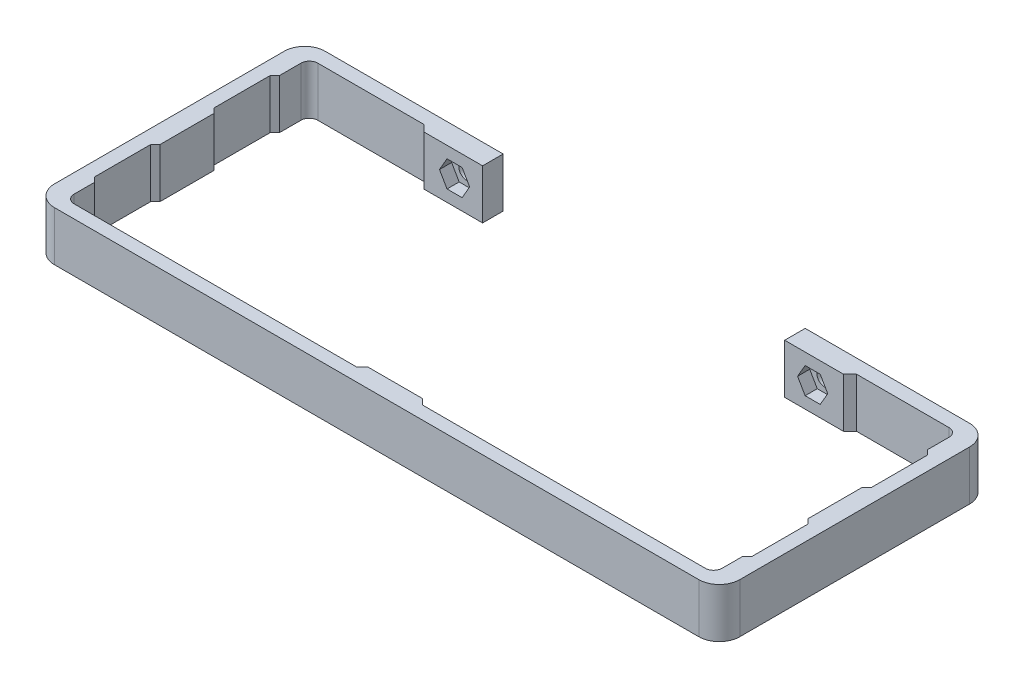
ISO-10303-21;
HEADER;
FILE_DESCRIPTION(('STEP AP214'),'2;1');
FILE_NAME('part.step','',(''),(''),'','','');
FILE_SCHEMA(('AUTOMOTIVE_DESIGN { 1 0 10303 214 1 1 1 1 }'));
ENDSEC;
DATA;
#1=APPLICATION_CONTEXT('core data for automotive mechanical design processes');
#2=APPLICATION_PROTOCOL_DEFINITION('international standard','automotive_design',2000,#1);
#3=PRODUCT_CONTEXT('',#1,'mechanical');
#4=PRODUCT('Part','Part','',(#3));
#5=PRODUCT_RELATED_PRODUCT_CATEGORY('part','',(#4));
#6=PRODUCT_DEFINITION_FORMATION('','',#4);
#7=PRODUCT_DEFINITION_CONTEXT('part definition',#1,'design');
#8=PRODUCT_DEFINITION('design','',#6,#7);
#9=PRODUCT_DEFINITION_SHAPE('','',#8);
#10=(LENGTH_UNIT() NAMED_UNIT(*) SI_UNIT(.MILLI.,.METRE.));
#11=(NAMED_UNIT(*) PLANE_ANGLE_UNIT() SI_UNIT($,.RADIAN.));
#12=(NAMED_UNIT(*) SI_UNIT($,.STERADIAN.) SOLID_ANGLE_UNIT());
#13=UNCERTAINTY_MEASURE_WITH_UNIT(LENGTH_MEASURE(1.E-05),#10,'distance_accuracy_value','');
#14=(GEOMETRIC_REPRESENTATION_CONTEXT(3) GLOBAL_UNCERTAINTY_ASSIGNED_CONTEXT((#13)) GLOBAL_UNIT_ASSIGNED_CONTEXT((#10,
#11,#12)) REPRESENTATION_CONTEXT('',''));
#15=CARTESIAN_POINT('',(0.,0.,0.));
#16=DIRECTION('',(0.,0.,1.));
#17=DIRECTION('',(1.,0.,0.));
#18=AXIS2_PLACEMENT_3D('',#15,#16,#17);
#19=CARTESIAN_POINT('',(117.397379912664,37.2165938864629,-54.));
#20=DIRECTION('',(1.,0.,0.));
#21=DIRECTION('',(0.,0.,-1.));
#22=AXIS2_PLACEMENT_3D('',#19,#20,#21);
#23=PLANE('',#22);
#24=DIRECTION('',(0.,0.,1.));
#25=VECTOR('',#24,1.);
#26=CARTESIAN_POINT('',(117.397379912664,47.8165938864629,-54.));
#27=LINE('',#26,#25);
#28=CARTESIAN_POINT('',(117.397379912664,47.8165938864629,-49.2));
#29=VERTEX_POINT('',#28);
#30=CARTESIAN_POINT('',(117.397379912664,47.8165938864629,-44.6));
#31=VERTEX_POINT('',#30);
#32=EDGE_CURVE('E552',#29,#31,#27,.T.);
#33=ORIENTED_EDGE('',*,*,#32,.F.);
#34=DIRECTION('',(0.,1.,0.));
#35=VECTOR('',#34,1.);
#36=CARTESIAN_POINT('',(117.397379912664,37.2165938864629,-49.2));
#37=LINE('',#36,#35);
#38=CARTESIAN_POINT('',(117.397379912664,37.2165938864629,-49.2));
#39=VERTEX_POINT('',#38);
#40=EDGE_CURVE('E758',#29,#39,#37,.F.);
#41=ORIENTED_EDGE('',*,*,#40,.T.);
#42=DIRECTION('',(0.,0.,1.));
#43=VECTOR('',#42,1.);
#44=CARTESIAN_POINT('',(117.397379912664,37.2165938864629,-54.));
#45=LINE('',#44,#43);
#46=CARTESIAN_POINT('',(117.397379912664,37.2165938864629,-44.6));
#47=VERTEX_POINT('',#46);
#48=EDGE_CURVE('E556',#39,#47,#45,.T.);
#49=ORIENTED_EDGE('',*,*,#48,.T.);
#50=DIRECTION('',(0.,-1.,0.));
#51=VECTOR('',#50,1.);
#52=CARTESIAN_POINT('',(117.397379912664,37.2165938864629,-44.6));
#53=LINE('',#52,#51);
#54=EDGE_CURVE('E657',#47,#31,#53,.F.);
#55=ORIENTED_EDGE('',*,*,#54,.T.);
#56=EDGE_LOOP('',(#33,#41,#49,#55));
#57=FACE_BOUND('',#56,.T.);
#58=ADVANCED_FACE('F33',(#57),#23,.F.);
#59=CARTESIAN_POINT('',(-21.4026200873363,37.2165938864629,-54.));
#60=DIRECTION('',(-1.,0.,0.));
#61=DIRECTION('',(0.,0.,1.));
#62=AXIS2_PLACEMENT_3D('',#59,#60,#61);
#63=PLANE('',#62);
#64=DIRECTION('',(0.,0.,1.));
#65=VECTOR('',#64,1.);
#66=CARTESIAN_POINT('',(-21.4026200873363,47.8165938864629,-54.));
#67=LINE('',#66,#65);
#68=CARTESIAN_POINT('',(-21.4026200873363,47.8165938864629,-5.00000000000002));
#69=VERTEX_POINT('',#68);
#70=CARTESIAN_POINT('',(-21.4026200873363,47.8165938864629,-0.599999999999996));
#71=VERTEX_POINT('',#70);
#72=EDGE_CURVE('E541',#69,#71,#67,.T.);
#73=ORIENTED_EDGE('',*,*,#72,.T.);
#74=DIRECTION('',(0.,1.,0.));
#75=VECTOR('',#74,1.);
#76=CARTESIAN_POINT('',(-21.4026200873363,37.2165938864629,-0.6));
#77=LINE('',#76,#75);
#78=CARTESIAN_POINT('',(-21.4026200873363,37.2165938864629,-0.599999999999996));
#79=VERTEX_POINT('',#78);
#80=EDGE_CURVE('E54',#71,#79,#77,.F.);
#81=ORIENTED_EDGE('',*,*,#80,.T.);
#82=DIRECTION('',(0.,0.,1.));
#83=VECTOR('',#82,1.);
#84=CARTESIAN_POINT('',(-21.4026200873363,37.2165938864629,-54.));
#85=LINE('',#84,#83);
#86=CARTESIAN_POINT('',(-21.4026200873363,37.2165938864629,-5.00000000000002));
#87=VERTEX_POINT('',#86);
#88=EDGE_CURVE('E538',#87,#79,#85,.T.);
#89=ORIENTED_EDGE('',*,*,#88,.F.);
#90=DIRECTION('',(0.,-1.,0.));
#91=VECTOR('',#90,1.);
#92=CARTESIAN_POINT('',(-21.4026200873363,37.2165938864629,-5.00000000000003));
#93=LINE('',#92,#91);
#94=EDGE_CURVE('E714',#87,#69,#93,.F.);
#95=ORIENTED_EDGE('',*,*,#94,.T.);
#96=EDGE_LOOP('',(#73,#81,#89,#95));
#97=FACE_BOUND('',#96,.T.);
#98=ADVANCED_FACE('F912',(#97),#63,.F.);
#99=CARTESIAN_POINT('',(-21.4026200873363,47.8165938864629,-30.6));
#100=VERTEX_POINT('',#99);
#101=CARTESIAN_POINT('',(-21.4026200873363,47.8165938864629,-19.));
#102=VERTEX_POINT('',#101);
#103=EDGE_CURVE('E546',#100,#102,#67,.T.);
#104=ORIENTED_EDGE('',*,*,#103,.T.);
#105=DIRECTION('',(0.,1.,0.));
#106=VECTOR('',#105,1.);
#107=CARTESIAN_POINT('',(-21.4026200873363,37.2165938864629,-19.));
#108=LINE('',#107,#106);
#109=CARTESIAN_POINT('',(-21.4026200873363,37.2165938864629,-19.));
#110=VERTEX_POINT('',#109);
#111=EDGE_CURVE('E709',#102,#110,#108,.F.);
#112=ORIENTED_EDGE('',*,*,#111,.T.);
#113=CARTESIAN_POINT('',(-21.4026200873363,37.2165938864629,-30.6));
#114=VERTEX_POINT('',#113);
#115=EDGE_CURVE('E542',#114,#110,#85,.T.);
#116=ORIENTED_EDGE('',*,*,#115,.F.);
#117=DIRECTION('',(0.,-1.,0.));
#118=VECTOR('',#117,1.);
#119=CARTESIAN_POINT('',(-21.4026200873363,37.2165938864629,-30.6));
#120=LINE('',#119,#118);
#121=EDGE_CURVE('E722',#114,#100,#120,.F.);
#122=ORIENTED_EDGE('',*,*,#121,.T.);
#123=EDGE_LOOP('',(#104,#112,#116,#122));
#124=FACE_BOUND('',#123,.T.);
#125=ADVANCED_FACE('F901',(#124),#63,.F.);
#126=CARTESIAN_POINT('',(117.397379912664,47.8165938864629,-30.6));
#127=VERTEX_POINT('',#126);
#128=CARTESIAN_POINT('',(117.397379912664,47.8165938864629,-19.));
#129=VERTEX_POINT('',#128);
#130=EDGE_CURVE('E555',#127,#129,#27,.T.);
#131=ORIENTED_EDGE('',*,*,#130,.F.);
#132=DIRECTION('',(0.,1.,0.));
#133=VECTOR('',#132,1.);
#134=CARTESIAN_POINT('',(117.397379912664,37.2165938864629,-30.6));
#135=LINE('',#134,#133);
#136=CARTESIAN_POINT('',(117.397379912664,37.2165938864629,-30.6));
#137=VERTEX_POINT('',#136);
#138=EDGE_CURVE('E684',#127,#137,#135,.F.);
#139=ORIENTED_EDGE('',*,*,#138,.T.);
#140=CARTESIAN_POINT('',(117.397379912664,37.2165938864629,-19.));
#141=VERTEX_POINT('',#140);
#142=EDGE_CURVE('E559',#137,#141,#45,.T.);
#143=ORIENTED_EDGE('',*,*,#142,.T.);
#144=DIRECTION('',(0.,-1.,0.));
#145=VECTOR('',#144,1.);
#146=CARTESIAN_POINT('',(117.397379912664,37.2165938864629,-19.));
#147=LINE('',#146,#145);
#148=EDGE_CURVE('E673',#141,#129,#147,.F.);
#149=ORIENTED_EDGE('',*,*,#148,.T.);
#150=EDGE_LOOP('',(#131,#139,#143,#149));
#151=FACE_BOUND('',#150,.T.);
#152=ADVANCED_FACE('F861',(#151),#23,.F.);
#153=CARTESIAN_POINT('',(87.7973799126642,42.5165938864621,-43.4));
#154=DIRECTION('',(0.,0.,-1.));
#155=DIRECTION('',(-1.,0.,0.));
#156=AXIS2_PLACEMENT_3D('',#153,#154,#155);
#157=CYLINDRICAL_SURFACE('',#156,1.70000000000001);
#158=CARTESIAN_POINT('',(87.7973799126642,42.5165938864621,-54.));
#159=DIRECTION('',(0.,0.,-1.));
#160=DIRECTION('',(-1.,0.,0.));
#161=AXIS2_PLACEMENT_3D('',#158,#159,#160);
#162=CIRCLE('',#161,1.70000000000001);
#163=CARTESIAN_POINT('',(86.0973799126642,42.5165938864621,-54.));
#164=VERTEX_POINT('',#163);
#165=EDGE_CURVE('E496',#164,#164,#162,.T.);
#166=ORIENTED_EDGE('',*,*,#165,.T.);
#167=EDGE_LOOP('',(#166));
#168=FACE_BOUND('',#167,.T.);
#169=CARTESIAN_POINT('',(87.7973799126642,42.5165938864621,-52.2));
#170=DIRECTION('',(0.,0.,1.));
#171=DIRECTION('',(1.,0.,0.));
#172=AXIS2_PLACEMENT_3D('',#169,#170,#171);
#173=CIRCLE('',#172,1.70000000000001);
#174=CARTESIAN_POINT('',(89.4973799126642,42.5165938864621,-52.2));
#175=VERTEX_POINT('',#174);
#176=EDGE_CURVE('E439',#175,#175,#173,.F.);
#177=ORIENTED_EDGE('',*,*,#176,.F.);
#178=EDGE_LOOP('',(#177));
#179=FACE_BOUND('',#178,.T.);
#180=ADVANCED_FACE('F1263',(#168,#179),#157,.F.);
#181=CARTESIAN_POINT('',(11.0973799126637,42.5165938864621,-43.4));
#182=DIRECTION('',(0.,0.,-1.));
#183=DIRECTION('',(-1.,0.,0.));
#184=AXIS2_PLACEMENT_3D('',#181,#182,#183);
#185=CYLINDRICAL_SURFACE('',#184,1.7);
#186=CARTESIAN_POINT('',(11.0973799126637,42.5165938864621,-54.));
#187=DIRECTION('',(0.,0.,-1.));
#188=DIRECTION('',(-1.,0.,0.));
#189=AXIS2_PLACEMENT_3D('',#186,#187,#188);
#190=CIRCLE('',#189,1.7);
#191=CARTESIAN_POINT('',(9.39737991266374,42.5165938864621,-54.));
#192=VERTEX_POINT('',#191);
#193=EDGE_CURVE('E499',#192,#192,#190,.T.);
#194=ORIENTED_EDGE('',*,*,#193,.T.);
#195=EDGE_LOOP('',(#194));
#196=FACE_BOUND('',#195,.T.);
#197=CARTESIAN_POINT('',(11.0973799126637,42.5165938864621,-52.2));
#198=DIRECTION('',(0.,0.,1.));
#199=DIRECTION('',(1.,0.,0.));
#200=AXIS2_PLACEMENT_3D('',#197,#198,#199);
#201=CIRCLE('',#200,1.7);
#202=CARTESIAN_POINT('',(12.7973799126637,42.5165938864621,-52.2));
#203=VERTEX_POINT('',#202);
#204=EDGE_CURVE('E485',#203,#203,#201,.F.);
#205=ORIENTED_EDGE('',*,*,#204,.F.);
#206=EDGE_LOOP('',(#205));
#207=FACE_BOUND('',#206,.T.);
#208=ADVANCED_FACE('F946',(#196,#207),#185,.F.);
#209=CARTESIAN_POINT('',(0.,0.,0.));
#210=DIRECTION('',(0.,0.,1.));
#211=DIRECTION('',(1.,0.,0.));
#212=AXIS2_PLACEMENT_3D('',#209,#210,#211);
#213=PLANE('',#212);
#214=DIRECTION('',(1.,0.,0.));
#215=VECTOR('',#214,1.);
#216=CARTESIAN_POINT('',(-25.4026200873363,37.2165938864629,0.));
#217=LINE('',#216,#215);
#218=CARTESIAN_POINT('',(42.1973799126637,37.2165938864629,0.));
#219=VERTEX_POINT('',#218);
#220=CARTESIAN_POINT('',(53.7973799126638,37.2165938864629,0.));
#221=VERTEX_POINT('',#220);
#222=EDGE_CURVE('E558',#219,#221,#217,.T.);
#223=ORIENTED_EDGE('',*,*,#222,.F.);
#224=DIRECTION('',(0.,-1.,0.));
#225=VECTOR('',#224,1.);
#226=CARTESIAN_POINT('',(42.1973799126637,0.,0.));
#227=LINE('',#226,#225);
#228=CARTESIAN_POINT('',(42.1973799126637,47.8165938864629,0.));
#229=VERTEX_POINT('',#228);
#230=EDGE_CURVE('E697',#219,#229,#227,.F.);
#231=ORIENTED_EDGE('',*,*,#230,.T.);
#232=DIRECTION('',(-1.,0.,0.));
#233=VECTOR('',#232,1.);
#234=CARTESIAN_POINT('',(-25.4026200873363,47.8165938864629,0.));
#235=LINE('',#234,#233);
#236=CARTESIAN_POINT('',(53.7973799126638,47.8165938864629,0.));
#237=VERTEX_POINT('',#236);
#238=EDGE_CURVE('E564',#237,#229,#235,.T.);
#239=ORIENTED_EDGE('',*,*,#238,.F.);
#240=DIRECTION('',(0.,1.,0.));
#241=VECTOR('',#240,1.);
#242=CARTESIAN_POINT('',(53.7973799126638,0.,0.));
#243=LINE('',#242,#241);
#244=EDGE_CURVE('E692',#237,#221,#243,.F.);
#245=ORIENTED_EDGE('',*,*,#244,.T.);
#246=EDGE_LOOP('',(#223,#231,#239,#245));
#247=FACE_BOUND('',#246,.T.);
#248=ADVANCED_FACE('F885',(#247),#213,.F.);
#249=CARTESIAN_POINT('',(-25.4026200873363,47.8165938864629,4.));
#250=DIRECTION('',(1.,0.,0.));
#251=DIRECTION('',(0.,1.,0.));
#252=AXIS2_PLACEMENT_3D('',#249,#250,#251);
#253=PLANE('',#252);
#254=DIRECTION('',(0.,0.,-1.));
#255=VECTOR('',#254,1.);
#256=CARTESIAN_POINT('',(-25.4026200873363,47.8165938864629,4.));
#257=LINE('',#256,#255);
#258=CARTESIAN_POINT('',(-25.4026200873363,47.8165938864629,-0.4));
#259=VERTEX_POINT('',#258);
#260=CARTESIAN_POINT('',(-25.4026200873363,47.8165938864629,-49.6));
#261=VERTEX_POINT('',#260);
#262=EDGE_CURVE('E567',#259,#261,#257,.T.);
#263=ORIENTED_EDGE('',*,*,#262,.T.);
#264=DIRECTION('',(0.,1.,0.));
#265=VECTOR('',#264,1.);
#266=CARTESIAN_POINT('',(-25.4026200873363,37.2165938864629,-49.6));
#267=LINE('',#266,#265);
#268=CARTESIAN_POINT('',(-25.4026200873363,37.2165938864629,-49.6));
#269=VERTEX_POINT('',#268);
#270=EDGE_CURVE('E609',#261,#269,#267,.F.);
#271=ORIENTED_EDGE('',*,*,#270,.T.);
#272=DIRECTION('',(0.,0.,-1.));
#273=VECTOR('',#272,1.);
#274=CARTESIAN_POINT('',(-25.4026200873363,37.2165938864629,4.));
#275=LINE('',#274,#273);
#276=CARTESIAN_POINT('',(-25.4026200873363,37.2165938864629,-0.4));
#277=VERTEX_POINT('',#276);
#278=EDGE_CURVE('E578',#277,#269,#275,.T.);
#279=ORIENTED_EDGE('',*,*,#278,.F.);
#280=DIRECTION('',(0.,-1.,0.));
#281=VECTOR('',#280,1.);
#282=CARTESIAN_POINT('',(-25.4026200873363,47.8165938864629,-0.4));
#283=LINE('',#282,#281);
#284=EDGE_CURVE('E607',#277,#259,#283,.F.);
#285=ORIENTED_EDGE('',*,*,#284,.T.);
#286=EDGE_LOOP('',(#263,#271,#279,#285));
#287=FACE_BOUND('',#286,.T.);
#288=ADVANCED_FACE('F945',(#287),#253,.F.);
#289=CARTESIAN_POINT('',(-25.4026200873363,37.2165938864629,4.));
#290=DIRECTION('',(0.,1.,0.));
#291=DIRECTION('',(0.,0.,1.));
#292=AXIS2_PLACEMENT_3D('',#289,#290,#291);
#293=PLANE('',#292);
#294=ORIENTED_EDGE('',*,*,#88,.T.);
#295=CARTESIAN_POINT('',(-19.6026200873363,37.2165938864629,-0.6));
#296=DIRECTION('',(0.,1.,0.));
#297=DIRECTION('',(0.,0.,1.));
#298=AXIS2_PLACEMENT_3D('',#295,#296,#297);
#299=CIRCLE('',#298,1.8);
#300=CARTESIAN_POINT('',(-19.6026200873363,37.2165938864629,1.2));
#301=VERTEX_POINT('',#300);
#302=EDGE_CURVE('E11',#79,#301,#299,.T.);
#303=ORIENTED_EDGE('',*,*,#302,.T.);
#304=DIRECTION('',(1.,0.,0.));
#305=VECTOR('',#304,1.);
#306=CARTESIAN_POINT('',(-25.4026200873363,37.2165938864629,1.2));
#307=LINE('',#306,#305);
#308=CARTESIAN_POINT('',(40.9973799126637,37.2165938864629,1.2));
#309=VERTEX_POINT('',#308);
#310=EDGE_CURVE('E817',#301,#309,#307,.T.);
#311=ORIENTED_EDGE('',*,*,#310,.T.);
#312=DIRECTION('',(-0.707106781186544,0.,0.707106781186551));
#313=VECTOR('',#312,1.);
#314=CARTESIAN_POINT('',(6.39737991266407,37.2165938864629,35.8));
#315=LINE('',#314,#313);
#316=EDGE_CURVE('E703',#309,#219,#315,.F.);
#317=ORIENTED_EDGE('',*,*,#316,.T.);
#318=ORIENTED_EDGE('',*,*,#222,.T.);
#319=DIRECTION('',(-0.707106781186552,0.,-0.707106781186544));
#320=VECTOR('',#319,1.);
#321=CARTESIAN_POINT('',(16.1973799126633,37.2165938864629,-37.6));
#322=LINE('',#321,#320);
#323=CARTESIAN_POINT('',(54.9973799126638,37.2165938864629,1.20000000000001));
#324=VERTEX_POINT('',#323);
#325=EDGE_CURVE('E695',#221,#324,#322,.F.);
#326=ORIENTED_EDGE('',*,*,#325,.T.);
#327=DIRECTION('',(1.,0.,0.));
#328=VECTOR('',#327,1.);
#329=CARTESIAN_POINT('',(-25.4026200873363,37.2165938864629,1.20000000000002));
#330=LINE('',#329,#328);
#331=CARTESIAN_POINT('',(115.597379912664,37.2165938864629,1.2));
#332=VERTEX_POINT('',#331);
#333=EDGE_CURVE('E822',#324,#332,#330,.T.);
#334=ORIENTED_EDGE('',*,*,#333,.T.);
#335=CARTESIAN_POINT('',(115.597379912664,37.2165938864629,-0.599999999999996));
#336=DIRECTION('',(0.,1.,0.));
#337=DIRECTION('',(0.,0.,1.));
#338=AXIS2_PLACEMENT_3D('',#335,#336,#337);
#339=CIRCLE('',#338,1.8);
#340=CARTESIAN_POINT('',(117.397379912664,37.2165938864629,-0.599999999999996));
#341=VERTEX_POINT('',#340);
#342=EDGE_CURVE('E780',#332,#341,#339,.T.);
#343=ORIENTED_EDGE('',*,*,#342,.T.);
#344=CARTESIAN_POINT('',(117.397379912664,37.2165938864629,-5.00000000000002));
#345=VERTEX_POINT('',#344);
#346=EDGE_CURVE('E554',#345,#341,#45,.T.);
#347=ORIENTED_EDGE('',*,*,#346,.F.);
#348=DIRECTION('',(-0.707106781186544,0.,0.707106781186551));
#349=VECTOR('',#348,1.);
#350=CARTESIAN_POINT('',(41.4973799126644,37.2165938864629,70.9));
#351=LINE('',#350,#349);
#352=CARTESIAN_POINT('',(118.397379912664,37.2165938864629,-6.00000000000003));
#353=VERTEX_POINT('',#352);
#354=EDGE_CURVE('E671',#345,#353,#351,.F.);
#355=ORIENTED_EDGE('',*,*,#354,.T.);
#356=DIRECTION('',(0.,0.,-1.));
#357=VECTOR('',#356,1.);
#358=CARTESIAN_POINT('',(118.397379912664,37.2165938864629,4.));
#359=LINE('',#358,#357);
#360=CARTESIAN_POINT('',(118.397379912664,37.2165938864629,-18.));
#361=VERTEX_POINT('',#360);
#362=EDGE_CURVE('E416',#353,#361,#359,.T.);
#363=ORIENTED_EDGE('',*,*,#362,.T.);
#364=DIRECTION('',(0.70710678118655,0.,0.707106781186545));
#365=VECTOR('',#364,1.);
#366=CARTESIAN_POINT('',(57.4973799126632,37.2165938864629,-78.9000000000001));
#367=LINE('',#366,#365);
#368=EDGE_CURVE('E678',#361,#141,#367,.F.);
#369=ORIENTED_EDGE('',*,*,#368,.T.);
#370=ORIENTED_EDGE('',*,*,#142,.F.);
#371=DIRECTION('',(-0.707106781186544,0.,0.707106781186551));
#372=VECTOR('',#371,1.);
#373=CARTESIAN_POINT('',(28.6973799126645,37.2165938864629,58.1000000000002));
#374=LINE('',#373,#372);
#375=CARTESIAN_POINT('',(118.397379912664,37.2165938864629,-31.6));
#376=VERTEX_POINT('',#375);
#377=EDGE_CURVE('E687',#137,#376,#374,.F.);
#378=ORIENTED_EDGE('',*,*,#377,.T.);
#379=DIRECTION('',(0.,0.,-1.));
#380=VECTOR('',#379,1.);
#381=CARTESIAN_POINT('',(118.397379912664,37.2165938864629,4.));
#382=LINE('',#381,#380);
#383=CARTESIAN_POINT('',(118.397379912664,37.2165938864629,-43.6));
#384=VERTEX_POINT('',#383);
#385=EDGE_CURVE('E840',#376,#384,#382,.T.);
#386=ORIENTED_EDGE('',*,*,#385,.T.);
#387=DIRECTION('',(0.70710678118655,0.,0.707106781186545));
#388=VECTOR('',#387,1.);
#389=CARTESIAN_POINT('',(70.2973799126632,37.2165938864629,-91.7000000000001));
#390=LINE('',#389,#388);
#391=EDGE_CURVE('E662',#384,#47,#390,.F.);
#392=ORIENTED_EDGE('',*,*,#391,.T.);
#393=ORIENTED_EDGE('',*,*,#48,.F.);
#394=CARTESIAN_POINT('',(115.597379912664,37.2165938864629,-49.2));
#395=DIRECTION('',(0.,1.,0.));
#396=DIRECTION('',(0.,0.,1.));
#397=AXIS2_PLACEMENT_3D('',#394,#395,#396);
#398=CIRCLE('',#397,1.8);
#399=CARTESIAN_POINT('',(115.597379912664,37.2165938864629,-51.));
#400=VERTEX_POINT('',#399);
#401=EDGE_CURVE('E776',#39,#400,#398,.T.);
#402=ORIENTED_EDGE('',*,*,#401,.T.);
#403=DIRECTION('',(-1.,0.,0.));
#404=VECTOR('',#403,1.);
#405=CARTESIAN_POINT('',(-25.4026200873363,37.2165938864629,-51.));
#406=LINE('',#405,#404);
#407=CARTESIAN_POINT('',(95.7973799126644,37.2165938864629,-51.));
#408=VERTEX_POINT('',#407);
#409=EDGE_CURVE('E815',#400,#408,#406,.T.);
#410=ORIENTED_EDGE('',*,*,#409,.T.);
#411=DIRECTION('',(0.707106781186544,0.,-0.707106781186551));
#412=VECTOR('',#411,1.);
#413=CARTESIAN_POINT('',(7.69737991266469,37.2165938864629,37.1000000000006));
#414=LINE('',#413,#412);
#415=CARTESIAN_POINT('',(94.3973799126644,37.2165938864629,-49.6));
#416=VERTEX_POINT('',#415);
#417=EDGE_CURVE('E744',#408,#416,#414,.F.);
#418=ORIENTED_EDGE('',*,*,#417,.T.);
#419=DIRECTION('',(1.,0.,0.));
#420=VECTOR('',#419,1.);
#421=CARTESIAN_POINT('',(117.397379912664,37.2165938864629,-49.6));
#422=LINE('',#421,#420);
#423=CARTESIAN_POINT('',(81.7973799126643,37.2165938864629,-49.6));
#424=VERTEX_POINT('',#423);
#425=EDGE_CURVE('E506',#424,#416,#422,.T.);
#426=ORIENTED_EDGE('',*,*,#425,.F.);
#427=DIRECTION('',(0.,0.,1.));
#428=VECTOR('',#427,1.);
#429=CARTESIAN_POINT('',(81.7973799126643,37.2165938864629,-54.));
#430=LINE('',#429,#428);
#431=CARTESIAN_POINT('',(81.7973799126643,37.2165938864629,-54.));
#432=VERTEX_POINT('',#431);
#433=EDGE_CURVE('E503',#432,#424,#430,.T.);
#434=ORIENTED_EDGE('',*,*,#433,.F.);
#435=DIRECTION('',(-1.,0.,0.));
#436=VECTOR('',#435,1.);
#437=CARTESIAN_POINT('',(121.397379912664,37.2165938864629,-54.));
#438=LINE('',#437,#436);
#439=CARTESIAN_POINT('',(116.997379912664,37.2165938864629,-54.));
#440=VERTEX_POINT('',#439);
#441=EDGE_CURVE('E545',#440,#432,#438,.T.);
#442=ORIENTED_EDGE('',*,*,#441,.F.);
#443=CARTESIAN_POINT('',(116.997379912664,37.2165938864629,-49.6));
#444=DIRECTION('',(0.,1.,0.));
#445=DIRECTION('',(0.,0.,1.));
#446=AXIS2_PLACEMENT_3D('',#443,#444,#445);
#447=CIRCLE('',#446,4.4);
#448=CARTESIAN_POINT('',(121.397379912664,37.2165938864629,-49.6));
#449=VERTEX_POINT('',#448);
#450=EDGE_CURVE('E590',#440,#449,#447,.F.);
#451=ORIENTED_EDGE('',*,*,#450,.T.);
#452=DIRECTION('',(0.,0.,-1.));
#453=VECTOR('',#452,1.);
#454=CARTESIAN_POINT('',(121.397379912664,37.2165938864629,4.));
#455=LINE('',#454,#453);
#456=CARTESIAN_POINT('',(121.397379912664,37.2165938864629,-0.4));
#457=VERTEX_POINT('',#456);
#458=EDGE_CURVE('E575',#457,#449,#455,.T.);
#459=ORIENTED_EDGE('',*,*,#458,.F.);
#460=CARTESIAN_POINT('',(116.997379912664,37.2165938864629,-0.4));
#461=DIRECTION('',(0.,1.,0.));
#462=DIRECTION('',(0.,0.,1.));
#463=AXIS2_PLACEMENT_3D('',#460,#461,#462);
#464=CIRCLE('',#463,4.4);
#465=CARTESIAN_POINT('',(116.997379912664,37.2165938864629,4.));
#466=VERTEX_POINT('',#465);
#467=EDGE_CURVE('E584',#457,#466,#464,.F.);
#468=ORIENTED_EDGE('',*,*,#467,.T.);
#469=DIRECTION('',(1.,0.,0.));
#470=VECTOR('',#469,1.);
#471=CARTESIAN_POINT('',(-25.4026200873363,37.2165938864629,4.));
#472=LINE('',#471,#470);
#473=CARTESIAN_POINT('',(-21.0026200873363,37.2165938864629,4.));
#474=VERTEX_POINT('',#473);
#475=EDGE_CURVE('E560',#474,#466,#472,.T.);
#476=ORIENTED_EDGE('',*,*,#475,.F.);
#477=CARTESIAN_POINT('',(-21.0026200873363,37.2165938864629,-0.4));
#478=DIRECTION('',(0.,1.,0.));
#479=DIRECTION('',(0.,0.,1.));
#480=AXIS2_PLACEMENT_3D('',#477,#478,#479);
#481=CIRCLE('',#480,4.4);
#482=EDGE_CURVE('E586',#474,#277,#481,.F.);
#483=ORIENTED_EDGE('',*,*,#482,.T.);
#484=ORIENTED_EDGE('',*,*,#278,.T.);
#485=CARTESIAN_POINT('',(-21.0026200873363,37.2165938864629,-49.6));
#486=DIRECTION('',(0.,1.,0.));
#487=DIRECTION('',(0.,0.,1.));
#488=AXIS2_PLACEMENT_3D('',#485,#486,#487);
#489=CIRCLE('',#488,4.4);
#490=CARTESIAN_POINT('',(-21.0026200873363,37.2165938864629,-54.));
#491=VERTEX_POINT('',#490);
#492=EDGE_CURVE('E588',#269,#491,#489,.F.);
#493=ORIENTED_EDGE('',*,*,#492,.T.);
#494=DIRECTION('',(-1.,0.,0.));
#495=VECTOR('',#494,1.);
#496=CARTESIAN_POINT('',(-25.4026200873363,37.2165938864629,-54.));
#497=LINE('',#496,#495);
#498=CARTESIAN_POINT('',(17.0973799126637,37.2165938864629,-54.));
#499=VERTEX_POINT('',#498);
#500=EDGE_CURVE('E535',#499,#491,#497,.T.);
#501=ORIENTED_EDGE('',*,*,#500,.F.);
#502=DIRECTION('',(0.,0.,-1.));
#503=VECTOR('',#502,1.);
#504=CARTESIAN_POINT('',(17.0973799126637,37.2165938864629,-54.));
#505=LINE('',#504,#503);
#506=CARTESIAN_POINT('',(17.0973799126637,37.2165938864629,-49.6));
#507=VERTEX_POINT('',#506);
#508=EDGE_CURVE('E520',#507,#499,#505,.T.);
#509=ORIENTED_EDGE('',*,*,#508,.F.);
#510=DIRECTION('',(1.,0.,0.));
#511=VECTOR('',#510,1.);
#512=CARTESIAN_POINT('',(-21.4026200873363,37.2165938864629,-49.6));
#513=LINE('',#512,#511);
#514=CARTESIAN_POINT('',(4.49737991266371,37.2165938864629,-49.6));
#515=VERTEX_POINT('',#514);
#516=EDGE_CURVE('E518',#515,#507,#513,.T.);
#517=ORIENTED_EDGE('',*,*,#516,.F.);
#518=DIRECTION('',(0.707106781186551,0.,0.707106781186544));
#519=VECTOR('',#518,1.);
#520=CARTESIAN_POINT('',(16.3473799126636,37.2165938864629,-37.7500000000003));
#521=LINE('',#520,#519);
#522=CARTESIAN_POINT('',(3.0973799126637,37.2165938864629,-51.));
#523=VERTEX_POINT('',#522);
#524=EDGE_CURVE('E753',#515,#523,#521,.F.);
#525=ORIENTED_EDGE('',*,*,#524,.T.);
#526=DIRECTION('',(-1.,0.,0.));
#527=VECTOR('',#526,1.);
#528=CARTESIAN_POINT('',(-25.4026200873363,37.2165938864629,-51.));
#529=LINE('',#528,#527);
#530=CARTESIAN_POINT('',(-19.6026200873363,37.2165938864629,-51.));
#531=VERTEX_POINT('',#530);
#532=EDGE_CURVE('E791',#523,#531,#529,.T.);
#533=ORIENTED_EDGE('',*,*,#532,.T.);
#534=CARTESIAN_POINT('',(-19.6026200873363,37.2165938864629,-49.2));
#535=DIRECTION('',(0.,1.,0.));
#536=DIRECTION('',(0.,0.,1.));
#537=AXIS2_PLACEMENT_3D('',#534,#535,#536);
#538=CIRCLE('',#537,1.8);
#539=CARTESIAN_POINT('',(-21.4026200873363,37.2165938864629,-49.2));
#540=VERTEX_POINT('',#539);
#541=EDGE_CURVE('E784',#531,#540,#538,.T.);
#542=ORIENTED_EDGE('',*,*,#541,.T.);
#543=CARTESIAN_POINT('',(-21.4026200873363,37.2165938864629,-44.6));
#544=VERTEX_POINT('',#543);
#545=EDGE_CURVE('E539',#540,#544,#85,.T.);
#546=ORIENTED_EDGE('',*,*,#545,.T.);
#547=DIRECTION('',(0.707106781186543,0.,-0.707106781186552));
#548=VECTOR('',#547,1.);
#549=CARTESIAN_POINT('',(-47.7026200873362,37.2165938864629,-18.2999999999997));
#550=LINE('',#549,#548);
#551=CARTESIAN_POINT('',(-22.4026200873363,37.2165938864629,-43.6));
#552=VERTEX_POINT('',#551);
#553=EDGE_CURVE('E736',#544,#552,#550,.F.);
#554=ORIENTED_EDGE('',*,*,#553,.T.);
#555=DIRECTION('',(0.,0.,1.));
#556=VECTOR('',#555,1.);
#557=CARTESIAN_POINT('',(-22.4026200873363,37.2165938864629,4.));
#558=LINE('',#557,#556);
#559=CARTESIAN_POINT('',(-22.4026200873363,37.2165938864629,-31.6));
#560=VERTEX_POINT('',#559);
#561=EDGE_CURVE('E829',#552,#560,#558,.T.);
#562=ORIENTED_EDGE('',*,*,#561,.T.);
#563=DIRECTION('',(-0.707106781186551,0.,-0.707106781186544));
#564=VECTOR('',#563,1.);
#565=CARTESIAN_POINT('',(-6.10262008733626,37.2165938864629,-15.3000000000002));
#566=LINE('',#565,#564);
#567=EDGE_CURVE('E727',#560,#114,#566,.F.);
#568=ORIENTED_EDGE('',*,*,#567,.T.);
#569=ORIENTED_EDGE('',*,*,#115,.T.);
#570=DIRECTION('',(0.707106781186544,0.,-0.707106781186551));
#571=VECTOR('',#570,1.);
#572=CARTESIAN_POINT('',(-34.9026200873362,37.2165938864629,-5.49999999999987));
#573=LINE('',#572,#571);
#574=CARTESIAN_POINT('',(-22.4026200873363,37.2165938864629,-18.));
#575=VERTEX_POINT('',#574);
#576=EDGE_CURVE('E712',#110,#575,#573,.F.);
#577=ORIENTED_EDGE('',*,*,#576,.T.);
#578=DIRECTION('',(0.,0.,1.));
#579=VECTOR('',#578,1.);
#580=CARTESIAN_POINT('',(-22.4026200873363,37.2165938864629,4.));
#581=LINE('',#580,#579);
#582=CARTESIAN_POINT('',(-22.4026200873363,37.2165938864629,-6.00000000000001));
#583=VERTEX_POINT('',#582);
#584=EDGE_CURVE('E837',#575,#583,#581,.T.);
#585=ORIENTED_EDGE('',*,*,#584,.T.);
#586=DIRECTION('',(-0.707106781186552,0.,-0.707106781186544));
#587=VECTOR('',#586,1.);
#588=CARTESIAN_POINT('',(-18.9026200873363,37.2165938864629,-2.50000000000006));
#589=LINE('',#588,#587);
#590=EDGE_CURVE('E719',#583,#87,#589,.F.);
#591=ORIENTED_EDGE('',*,*,#590,.T.);
#592=EDGE_LOOP('',(#294,#303,#311,#317,#318,#326,#334,#343,#347,#355,#363,#369,#370,#378,#386,
#392,#393,#402,#410,#418,#426,#434,#442,#451,#459,#468,#476,#483,#484,#493,#501,#509,#517,#525,
#533,#542,#546,#554,#562,#568,#569,#577,#585,#591));
#593=FACE_BOUND('',#592,.T.);
#594=ADVANCED_FACE('F789',(#593),#293,.F.);
#595=CARTESIAN_POINT('',(121.397379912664,47.8165938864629,4.));
#596=DIRECTION('',(-1.,0.,0.));
#597=DIRECTION('',(0.,0.,1.));
#598=AXIS2_PLACEMENT_3D('',#595,#596,#597);
#599=PLANE('',#598);
#600=ORIENTED_EDGE('',*,*,#458,.T.);
#601=DIRECTION('',(0.,-1.,0.));
#602=VECTOR('',#601,1.);
#603=CARTESIAN_POINT('',(121.397379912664,47.8165938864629,-49.6));
#604=LINE('',#603,#602);
#605=CARTESIAN_POINT('',(121.397379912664,47.8165938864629,-49.6));
#606=VERTEX_POINT('',#605);
#607=EDGE_CURVE('E594',#449,#606,#604,.F.);
#608=ORIENTED_EDGE('',*,*,#607,.T.);
#609=DIRECTION('',(0.,0.,-1.));
#610=VECTOR('',#609,1.);
#611=CARTESIAN_POINT('',(121.397379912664,47.8165938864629,4.));
#612=LINE('',#611,#610);
#613=CARTESIAN_POINT('',(121.397379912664,47.8165938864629,-0.4));
#614=VERTEX_POINT('',#613);
#615=EDGE_CURVE('E572',#614,#606,#612,.T.);
#616=ORIENTED_EDGE('',*,*,#615,.F.);
#617=DIRECTION('',(0.,1.,0.));
#618=VECTOR('',#617,1.);
#619=CARTESIAN_POINT('',(121.397379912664,37.2165938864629,-0.4));
#620=LINE('',#619,#618);
#621=EDGE_CURVE('E592',#614,#457,#620,.F.);
#622=ORIENTED_EDGE('',*,*,#621,.T.);
#623=EDGE_LOOP('',(#600,#608,#616,#622));
#624=FACE_BOUND('',#623,.T.);
#625=ADVANCED_FACE('F949',(#624),#599,.F.);
#626=CARTESIAN_POINT('',(-25.4026200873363,47.8165938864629,4.));
#627=DIRECTION('',(0.,-1.,0.));
#628=DIRECTION('',(0.,0.,-1.));
#629=AXIS2_PLACEMENT_3D('',#626,#627,#628);
#630=PLANE('',#629);
#631=DIRECTION('',(1.,0.,0.));
#632=VECTOR('',#631,1.);
#633=CARTESIAN_POINT('',(-21.4026200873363,47.8165938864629,1.2));
#634=LINE('',#633,#632);
#635=CARTESIAN_POINT('',(-19.6026200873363,47.8165938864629,1.2));
#636=VERTEX_POINT('',#635);
#637=CARTESIAN_POINT('',(40.9973799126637,47.8165938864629,1.2));
#638=VERTEX_POINT('',#637);
#639=EDGE_CURVE('E810',#636,#638,#634,.T.);
#640=ORIENTED_EDGE('',*,*,#639,.F.);
#641=CARTESIAN_POINT('',(-19.6026200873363,47.8165938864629,-0.6));
#642=DIRECTION('',(0.,-1.,0.));
#643=DIRECTION('',(0.,0.,-1.));
#644=AXIS2_PLACEMENT_3D('',#641,#642,#643);
#645=CIRCLE('',#644,1.8);
#646=EDGE_CURVE('E41',#636,#71,#645,.T.);
#647=ORIENTED_EDGE('',*,*,#646,.T.);
#648=ORIENTED_EDGE('',*,*,#72,.F.);
#649=DIRECTION('',(0.707106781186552,0.,0.707106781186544));
#650=VECTOR('',#649,1.);
#651=CARTESIAN_POINT('',(-18.9026200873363,47.8165938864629,-2.50000000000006));
#652=LINE('',#651,#650);
#653=CARTESIAN_POINT('',(-22.4026200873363,47.8165938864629,-6.00000000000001));
#654=VERTEX_POINT('',#653);
#655=EDGE_CURVE('E717',#69,#654,#652,.F.);
#656=ORIENTED_EDGE('',*,*,#655,.T.);
#657=DIRECTION('',(0.,0.,1.));
#658=VECTOR('',#657,1.);
#659=CARTESIAN_POINT('',(-22.4026200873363,47.8165938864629,-4.));
#660=LINE('',#659,#658);
#661=CARTESIAN_POINT('',(-22.4026200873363,47.8165938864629,-18.));
#662=VERTEX_POINT('',#661);
#663=EDGE_CURVE('E830',#662,#654,#660,.T.);
#664=ORIENTED_EDGE('',*,*,#663,.F.);
#665=DIRECTION('',(-0.707106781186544,0.,0.707106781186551));
#666=VECTOR('',#665,1.);
#667=CARTESIAN_POINT('',(-34.9026200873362,47.8165938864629,-5.49999999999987));
#668=LINE('',#667,#666);
#669=EDGE_CURVE('E706',#662,#102,#668,.F.);
#670=ORIENTED_EDGE('',*,*,#669,.T.);
#671=ORIENTED_EDGE('',*,*,#103,.F.);
#672=DIRECTION('',(0.707106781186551,0.,0.707106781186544));
#673=VECTOR('',#672,1.);
#674=CARTESIAN_POINT('',(-6.10262008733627,47.8165938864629,-15.3000000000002));
#675=LINE('',#674,#673);
#676=CARTESIAN_POINT('',(-22.4026200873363,47.8165938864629,-31.6));
#677=VERTEX_POINT('',#676);
#678=EDGE_CURVE('E725',#100,#677,#675,.F.);
#679=ORIENTED_EDGE('',*,*,#678,.T.);
#680=DIRECTION('',(0.,0.,1.));
#681=VECTOR('',#680,1.);
#682=CARTESIAN_POINT('',(-22.4026200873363,47.8165938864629,-45.6));
#683=LINE('',#682,#681);
#684=CARTESIAN_POINT('',(-22.4026200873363,47.8165938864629,-43.6));
#685=VERTEX_POINT('',#684);
#686=EDGE_CURVE('E825',#685,#677,#683,.T.);
#687=ORIENTED_EDGE('',*,*,#686,.F.);
#688=DIRECTION('',(-0.707106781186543,0.,0.707106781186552));
#689=VECTOR('',#688,1.);
#690=CARTESIAN_POINT('',(-47.7026200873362,47.8165938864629,-18.2999999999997));
#691=LINE('',#690,#689);
#692=CARTESIAN_POINT('',(-21.4026200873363,47.8165938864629,-44.6));
#693=VERTEX_POINT('',#692);
#694=EDGE_CURVE('E730',#685,#693,#691,.F.);
#695=ORIENTED_EDGE('',*,*,#694,.T.);
#696=CARTESIAN_POINT('',(-21.4026200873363,47.8165938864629,-49.2));
#697=VERTEX_POINT('',#696);
#698=EDGE_CURVE('E543',#697,#693,#67,.T.);
#699=ORIENTED_EDGE('',*,*,#698,.F.);
#700=CARTESIAN_POINT('',(-19.6026200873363,47.8165938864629,-49.2));
#701=DIRECTION('',(0.,-1.,0.));
#702=DIRECTION('',(0.,0.,-1.));
#703=AXIS2_PLACEMENT_3D('',#700,#701,#702);
#704=CIRCLE('',#703,1.8);
#705=CARTESIAN_POINT('',(-19.6026200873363,47.8165938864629,-51.));
#706=VERTEX_POINT('',#705);
#707=EDGE_CURVE('E782',#697,#706,#704,.T.);
#708=ORIENTED_EDGE('',*,*,#707,.T.);
#709=DIRECTION('',(-1.,0.,0.));
#710=VECTOR('',#709,1.);
#711=CARTESIAN_POINT('',(-21.4026200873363,47.8165938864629,-51.));
#712=LINE('',#711,#710);
#713=CARTESIAN_POINT('',(3.0973799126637,47.8165938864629,-51.));
#714=VERTEX_POINT('',#713);
#715=EDGE_CURVE('E804',#714,#706,#712,.T.);
#716=ORIENTED_EDGE('',*,*,#715,.F.);
#717=DIRECTION('',(-0.707106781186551,0.,-0.707106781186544));
#718=VECTOR('',#717,1.);
#719=CARTESIAN_POINT('',(16.3473799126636,47.8165938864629,-37.7500000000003));
#720=LINE('',#719,#718);
#721=CARTESIAN_POINT('',(4.49737991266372,47.8165938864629,-49.6));
#722=VERTEX_POINT('',#721);
#723=EDGE_CURVE('E747',#714,#722,#720,.F.);
#724=ORIENTED_EDGE('',*,*,#723,.T.);
#725=DIRECTION('',(1.,0.,0.));
#726=VECTOR('',#725,1.);
#727=CARTESIAN_POINT('',(-21.4026200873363,47.8165938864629,-49.6));
#728=LINE('',#727,#726);
#729=CARTESIAN_POINT('',(17.0973799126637,47.8165938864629,-49.6));
#730=VERTEX_POINT('',#729);
#731=EDGE_CURVE('E515',#722,#730,#728,.T.);
#732=ORIENTED_EDGE('',*,*,#731,.T.);
#733=DIRECTION('',(0.,0.,-1.));
#734=VECTOR('',#733,1.);
#735=CARTESIAN_POINT('',(17.0973799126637,47.8165938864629,-54.));
#736=LINE('',#735,#734);
#737=CARTESIAN_POINT('',(17.0973799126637,47.8165938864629,-54.));
#738=VERTEX_POINT('',#737);
#739=EDGE_CURVE('E521',#730,#738,#736,.T.);
#740=ORIENTED_EDGE('',*,*,#739,.T.);
#741=DIRECTION('',(1.,0.,0.));
#742=VECTOR('',#741,1.);
#743=CARTESIAN_POINT('',(-25.4026200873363,47.8165938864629,-54.));
#744=LINE('',#743,#742);
#745=CARTESIAN_POINT('',(-21.0026200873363,47.8165938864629,-54.));
#746=VERTEX_POINT('',#745);
#747=EDGE_CURVE('E531',#746,#738,#744,.T.);
#748=ORIENTED_EDGE('',*,*,#747,.F.);
#749=CARTESIAN_POINT('',(-21.0026200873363,47.8165938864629,-49.6));
#750=DIRECTION('',(0.,-1.,0.));
#751=DIRECTION('',(0.,0.,-1.));
#752=AXIS2_PLACEMENT_3D('',#749,#750,#751);
#753=CIRCLE('',#752,4.4);
#754=EDGE_CURVE('E600',#746,#261,#753,.F.);
#755=ORIENTED_EDGE('',*,*,#754,.T.);
#756=ORIENTED_EDGE('',*,*,#262,.F.);
#757=CARTESIAN_POINT('',(-21.0026200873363,47.8165938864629,-0.4));
#758=DIRECTION('',(0.,-1.,0.));
#759=DIRECTION('',(0.,0.,-1.));
#760=AXIS2_PLACEMENT_3D('',#757,#758,#759);
#761=CIRCLE('',#760,4.4);
#762=CARTESIAN_POINT('',(-21.0026200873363,47.8165938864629,4.));
#763=VERTEX_POINT('',#762);
#764=EDGE_CURVE('E598',#259,#763,#761,.F.);
#765=ORIENTED_EDGE('',*,*,#764,.T.);
#766=DIRECTION('',(-1.,0.,0.));
#767=VECTOR('',#766,1.);
#768=CARTESIAN_POINT('',(-25.4026200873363,47.8165938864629,4.));
#769=LINE('',#768,#767);
#770=CARTESIAN_POINT('',(116.997379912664,47.8165938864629,4.));
#771=VERTEX_POINT('',#770);
#772=EDGE_CURVE('E563',#771,#763,#769,.T.);
#773=ORIENTED_EDGE('',*,*,#772,.F.);
#774=CARTESIAN_POINT('',(116.997379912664,47.8165938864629,-0.4));
#775=DIRECTION('',(0.,-1.,0.));
#776=DIRECTION('',(0.,0.,-1.));
#777=AXIS2_PLACEMENT_3D('',#774,#775,#776);
#778=CIRCLE('',#777,4.4);
#779=EDGE_CURVE('E596',#771,#614,#778,.F.);
#780=ORIENTED_EDGE('',*,*,#779,.T.);
#781=ORIENTED_EDGE('',*,*,#615,.T.);
#782=CARTESIAN_POINT('',(116.997379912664,47.8165938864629,-49.6));
#783=DIRECTION('',(0.,-1.,0.));
#784=DIRECTION('',(0.,0.,-1.));
#785=AXIS2_PLACEMENT_3D('',#782,#783,#784);
#786=CIRCLE('',#785,4.4);
#787=CARTESIAN_POINT('',(116.997379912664,47.8165938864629,-54.));
#788=VERTEX_POINT('',#787);
#789=EDGE_CURVE('E602',#606,#788,#786,.F.);
#790=ORIENTED_EDGE('',*,*,#789,.T.);
#791=DIRECTION('',(1.,0.,0.));
#792=VECTOR('',#791,1.);
#793=CARTESIAN_POINT('',(121.397379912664,47.8165938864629,-54.));
#794=LINE('',#793,#792);
#795=CARTESIAN_POINT('',(81.7973799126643,47.8165938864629,-54.));
#796=VERTEX_POINT('',#795);
#797=EDGE_CURVE('E548',#796,#788,#794,.T.);
#798=ORIENTED_EDGE('',*,*,#797,.F.);
#799=DIRECTION('',(0.,0.,1.));
#800=VECTOR('',#799,1.);
#801=CARTESIAN_POINT('',(81.7973799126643,47.8165938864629,-54.));
#802=LINE('',#801,#800);
#803=CARTESIAN_POINT('',(81.7973799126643,47.8165938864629,-49.6));
#804=VERTEX_POINT('',#803);
#805=EDGE_CURVE('E502',#796,#804,#802,.T.);
#806=ORIENTED_EDGE('',*,*,#805,.T.);
#807=DIRECTION('',(1.,0.,0.));
#808=VECTOR('',#807,1.);
#809=CARTESIAN_POINT('',(117.397379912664,47.8165938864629,-49.6));
#810=LINE('',#809,#808);
#811=CARTESIAN_POINT('',(94.3973799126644,47.8165938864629,-49.6));
#812=VERTEX_POINT('',#811);
#813=EDGE_CURVE('E507',#804,#812,#810,.T.);
#814=ORIENTED_EDGE('',*,*,#813,.T.);
#815=DIRECTION('',(-0.707106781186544,0.,0.707106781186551));
#816=VECTOR('',#815,1.);
#817=CARTESIAN_POINT('',(7.69737991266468,47.8165938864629,37.1000000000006));
#818=LINE('',#817,#816);
#819=CARTESIAN_POINT('',(95.7973799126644,47.8165938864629,-51.));
#820=VERTEX_POINT('',#819);
#821=EDGE_CURVE('E741',#812,#820,#818,.F.);
#822=ORIENTED_EDGE('',*,*,#821,.T.);
#823=DIRECTION('',(-1.,0.,0.));
#824=VECTOR('',#823,1.);
#825=CARTESIAN_POINT('',(117.397379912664,47.8165938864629,-51.));
#826=LINE('',#825,#824);
#827=CARTESIAN_POINT('',(115.597379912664,47.8165938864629,-51.));
#828=VERTEX_POINT('',#827);
#829=EDGE_CURVE('E808',#828,#820,#826,.T.);
#830=ORIENTED_EDGE('',*,*,#829,.F.);
#831=CARTESIAN_POINT('',(115.597379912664,47.8165938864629,-49.2));
#832=DIRECTION('',(0.,-1.,0.));
#833=DIRECTION('',(0.,0.,-1.));
#834=AXIS2_PLACEMENT_3D('',#831,#832,#833);
#835=CIRCLE('',#834,1.8);
#836=EDGE_CURVE('E774',#828,#29,#835,.T.);
#837=ORIENTED_EDGE('',*,*,#836,.T.);
#838=ORIENTED_EDGE('',*,*,#32,.T.);
#839=DIRECTION('',(-0.70710678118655,0.,-0.707106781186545));
#840=VECTOR('',#839,1.);
#841=CARTESIAN_POINT('',(70.2973799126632,47.8165938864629,-91.7000000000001));
#842=LINE('',#841,#840);
#843=CARTESIAN_POINT('',(118.397379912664,47.8165938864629,-43.6));
#844=VERTEX_POINT('',#843);
#845=EDGE_CURVE('E660',#31,#844,#842,.F.);
#846=ORIENTED_EDGE('',*,*,#845,.T.);
#847=DIRECTION('',(0.,0.,-1.));
#848=VECTOR('',#847,1.);
#849=CARTESIAN_POINT('',(118.397379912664,47.8165938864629,-45.6));
#850=LINE('',#849,#848);
#851=CARTESIAN_POINT('',(118.397379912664,47.8165938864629,-31.6));
#852=VERTEX_POINT('',#851);
#853=EDGE_CURVE('E826',#852,#844,#850,.T.);
#854=ORIENTED_EDGE('',*,*,#853,.F.);
#855=DIRECTION('',(0.707106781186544,0.,-0.707106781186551));
#856=VECTOR('',#855,1.);
#857=CARTESIAN_POINT('',(28.6973799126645,47.8165938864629,58.1000000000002));
#858=LINE('',#857,#856);
#859=EDGE_CURVE('E681',#852,#127,#858,.F.);
#860=ORIENTED_EDGE('',*,*,#859,.T.);
#861=ORIENTED_EDGE('',*,*,#130,.T.);
#862=DIRECTION('',(-0.70710678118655,0.,-0.707106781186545));
#863=VECTOR('',#862,1.);
#864=CARTESIAN_POINT('',(57.4973799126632,47.8165938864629,-78.9000000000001));
#865=LINE('',#864,#863);
#866=CARTESIAN_POINT('',(118.397379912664,47.8165938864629,-18.));
#867=VERTEX_POINT('',#866);
#868=EDGE_CURVE('E676',#129,#867,#865,.F.);
#869=ORIENTED_EDGE('',*,*,#868,.T.);
#870=DIRECTION('',(0.,0.,-1.));
#871=VECTOR('',#870,1.);
#872=CARTESIAN_POINT('',(118.397379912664,47.8165938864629,-4.));
#873=LINE('',#872,#871);
#874=CARTESIAN_POINT('',(118.397379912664,47.8165938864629,-6.00000000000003));
#875=VERTEX_POINT('',#874);
#876=EDGE_CURVE('E842',#875,#867,#873,.T.);
#877=ORIENTED_EDGE('',*,*,#876,.F.);
#878=DIRECTION('',(0.707106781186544,0.,-0.707106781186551));
#879=VECTOR('',#878,1.);
#880=CARTESIAN_POINT('',(41.4973799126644,47.8165938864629,70.9));
#881=LINE('',#880,#879);
#882=CARTESIAN_POINT('',(117.397379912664,47.8165938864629,-5.00000000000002));
#883=VERTEX_POINT('',#882);
#884=EDGE_CURVE('E665',#875,#883,#881,.F.);
#885=ORIENTED_EDGE('',*,*,#884,.T.);
#886=CARTESIAN_POINT('',(117.397379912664,47.8165938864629,-0.599999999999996));
#887=VERTEX_POINT('',#886);
#888=EDGE_CURVE('E551',#883,#887,#27,.T.);
#889=ORIENTED_EDGE('',*,*,#888,.T.);
#890=CARTESIAN_POINT('',(115.597379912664,47.8165938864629,-0.599999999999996));
#891=DIRECTION('',(0.,-1.,0.));
#892=DIRECTION('',(0.,0.,-1.));
#893=AXIS2_PLACEMENT_3D('',#890,#891,#892);
#894=CIRCLE('',#893,1.8);
#895=CARTESIAN_POINT('',(115.597379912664,47.8165938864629,1.2));
#896=VERTEX_POINT('',#895);
#897=EDGE_CURVE('E778',#887,#896,#894,.T.);
#898=ORIENTED_EDGE('',*,*,#897,.T.);
#899=DIRECTION('',(1.,0.,0.));
#900=VECTOR('',#899,1.);
#901=CARTESIAN_POINT('',(117.397379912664,47.8165938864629,1.2));
#902=LINE('',#901,#900);
#903=CARTESIAN_POINT('',(54.9973799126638,47.8165938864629,1.20000000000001));
#904=VERTEX_POINT('',#903);
#905=EDGE_CURVE('E819',#904,#896,#902,.T.);
#906=ORIENTED_EDGE('',*,*,#905,.F.);
#907=DIRECTION('',(0.707106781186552,0.,0.707106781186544));
#908=VECTOR('',#907,1.);
#909=CARTESIAN_POINT('',(16.1973799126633,47.8165938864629,-37.6));
#910=LINE('',#909,#908);
#911=EDGE_CURVE('E689',#904,#237,#910,.F.);
#912=ORIENTED_EDGE('',*,*,#911,.T.);
#913=ORIENTED_EDGE('',*,*,#238,.T.);
#914=DIRECTION('',(0.707106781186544,0.,-0.707106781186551));
#915=VECTOR('',#914,1.);
#916=CARTESIAN_POINT('',(6.39737991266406,47.8165938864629,35.8));
#917=LINE('',#916,#915);
#918=EDGE_CURVE('E700',#229,#638,#917,.F.);
#919=ORIENTED_EDGE('',*,*,#918,.T.);
#920=EDGE_LOOP('',(#640,#647,#648,#656,#664,#670,#671,#679,#687,#695,#699,#708,#716,#724,#732,
#740,#748,#755,#756,#765,#773,#780,#781,#790,#798,#806,#814,#822,#830,#837,#838,#846,#854,#860,
#861,#869,#877,#885,#889,#898,#906,#912,#913,#919));
#921=FACE_BOUND('',#920,.T.);
#922=ADVANCED_FACE('F803',(#921),#630,.F.);
#923=CARTESIAN_POINT('',(0.,0.,4.));
#924=DIRECTION('',(0.,0.,1.));
#925=DIRECTION('',(1.,0.,0.));
#926=AXIS2_PLACEMENT_3D('',#923,#924,#925);
#927=PLANE('',#926);
#928=ORIENTED_EDGE('',*,*,#772,.T.);
#929=DIRECTION('',(0.,-1.,0.));
#930=VECTOR('',#929,1.);
#931=CARTESIAN_POINT('',(-21.0026200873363,37.2165938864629,4.));
#932=LINE('',#931,#930);
#933=EDGE_CURVE('E614',#763,#474,#932,.T.);
#934=ORIENTED_EDGE('',*,*,#933,.T.);
#935=ORIENTED_EDGE('',*,*,#475,.T.);
#936=DIRECTION('',(0.,1.,0.));
#937=VECTOR('',#936,1.);
#938=CARTESIAN_POINT('',(116.997379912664,47.8165938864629,4.));
#939=LINE('',#938,#937);
#940=EDGE_CURVE('E611',#466,#771,#939,.T.);
#941=ORIENTED_EDGE('',*,*,#940,.T.);
#942=EDGE_LOOP('',(#928,#934,#935,#941));
#943=FACE_BOUND('',#942,.T.);
#944=ADVANCED_FACE('F936',(#943),#927,.T.);
#945=ORIENTED_EDGE('',*,*,#346,.T.);
#946=DIRECTION('',(0.,1.,0.));
#947=VECTOR('',#946,1.);
#948=CARTESIAN_POINT('',(117.397379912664,47.8165938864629,-0.599999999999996));
#949=LINE('',#948,#947);
#950=EDGE_CURVE('E760',#341,#887,#949,.T.);
#951=ORIENTED_EDGE('',*,*,#950,.T.);
#952=ORIENTED_EDGE('',*,*,#888,.F.);
#953=DIRECTION('',(0.,1.,0.));
#954=VECTOR('',#953,1.);
#955=CARTESIAN_POINT('',(117.397379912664,37.2165938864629,-5.00000000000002));
#956=LINE('',#955,#954);
#957=EDGE_CURVE('E668',#883,#345,#956,.F.);
#958=ORIENTED_EDGE('',*,*,#957,.T.);
#959=EDGE_LOOP('',(#945,#951,#952,#958));
#960=FACE_BOUND('',#959,.T.);
#961=ADVANCED_FACE('F867',(#960),#23,.F.);
#962=CARTESIAN_POINT('',(0.,0.,-54.));
#963=DIRECTION('',(0.,0.,1.));
#964=DIRECTION('',(1.,0.,0.));
#965=AXIS2_PLACEMENT_3D('',#962,#963,#964);
#966=PLANE('',#965);
#967=ORIENTED_EDGE('',*,*,#165,.F.);
#968=EDGE_LOOP('',(#967));
#969=FACE_BOUND('',#968,.T.);
#970=ORIENTED_EDGE('',*,*,#797,.T.);
#971=DIRECTION('',(0.,-1.,0.));
#972=VECTOR('',#971,1.);
#973=CARTESIAN_POINT('',(116.997379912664,0.,-54.));
#974=LINE('',#973,#972);
#975=EDGE_CURVE('E581',#788,#440,#974,.T.);
#976=ORIENTED_EDGE('',*,*,#975,.T.);
#977=ORIENTED_EDGE('',*,*,#441,.T.);
#978=DIRECTION('',(0.,1.,0.));
#979=VECTOR('',#978,1.);
#980=CARTESIAN_POINT('',(81.7973799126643,37.2165938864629,-54.));
#981=LINE('',#980,#979);
#982=EDGE_CURVE('E509',#432,#796,#981,.T.);
#983=ORIENTED_EDGE('',*,*,#982,.T.);
#984=EDGE_LOOP('',(#970,#976,#977,#983));
#985=FACE_BOUND('',#984,.T.);
#986=ADVANCED_FACE('F925',(#969,#985),#966,.F.);
#987=ORIENTED_EDGE('',*,*,#545,.F.);
#988=DIRECTION('',(0.,1.,0.));
#989=VECTOR('',#988,1.);
#990=CARTESIAN_POINT('',(-21.4026200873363,47.8165938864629,-49.2));
#991=LINE('',#990,#989);
#992=EDGE_CURVE('E765',#540,#697,#991,.T.);
#993=ORIENTED_EDGE('',*,*,#992,.T.);
#994=ORIENTED_EDGE('',*,*,#698,.T.);
#995=DIRECTION('',(0.,1.,0.));
#996=VECTOR('',#995,1.);
#997=CARTESIAN_POINT('',(-21.4026200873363,37.2165938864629,-44.6));
#998=LINE('',#997,#996);
#999=EDGE_CURVE('E733',#693,#544,#998,.F.);
#1000=ORIENTED_EDGE('',*,*,#999,.T.);
#1001=EDGE_LOOP('',(#987,#993,#994,#1000));
#1002=FACE_BOUND('',#1001,.T.);
#1003=ADVANCED_FACE('F796',(#1002),#63,.F.);
#1004=CARTESIAN_POINT('',(0.,0.,-54.));
#1005=DIRECTION('',(0.,0.,-1.));
#1006=DIRECTION('',(-1.,0.,0.));
#1007=AXIS2_PLACEMENT_3D('',#1004,#1005,#1006);
#1008=PLANE('',#1007);
#1009=ORIENTED_EDGE('',*,*,#193,.F.);
#1010=EDGE_LOOP('',(#1009));
#1011=FACE_BOUND('',#1010,.T.);
#1012=ORIENTED_EDGE('',*,*,#500,.T.);
#1013=DIRECTION('',(0.,1.,0.));
#1014=VECTOR('',#1013,1.);
#1015=CARTESIAN_POINT('',(-21.0026200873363,47.8165938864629,-54.));
#1016=LINE('',#1015,#1014);
#1017=EDGE_CURVE('E604',#491,#746,#1016,.T.);
#1018=ORIENTED_EDGE('',*,*,#1017,.T.);
#1019=ORIENTED_EDGE('',*,*,#747,.T.);
#1020=DIRECTION('',(0.,1.,0.));
#1021=VECTOR('',#1020,1.);
#1022=CARTESIAN_POINT('',(17.0973799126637,37.2165938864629,-54.));
#1023=LINE('',#1022,#1021);
#1024=EDGE_CURVE('E528',#499,#738,#1023,.T.);
#1025=ORIENTED_EDGE('',*,*,#1024,.F.);
#1026=EDGE_LOOP('',(#1012,#1018,#1019,#1025));
#1027=FACE_BOUND('',#1026,.T.);
#1028=ADVANCED_FACE('F924',(#1011,#1027),#1008,.T.);
#1029=CARTESIAN_POINT('',(17.0973799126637,37.2165938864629,-54.));
#1030=DIRECTION('',(1.,0.,0.));
#1031=DIRECTION('',(0.,0.,-1.));
#1032=AXIS2_PLACEMENT_3D('',#1029,#1030,#1031);
#1033=PLANE('',#1032);
#1034=ORIENTED_EDGE('',*,*,#739,.F.);
#1035=DIRECTION('',(0.,1.,0.));
#1036=VECTOR('',#1035,1.);
#1037=CARTESIAN_POINT('',(17.0973799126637,37.2165938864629,-49.6));
#1038=LINE('',#1037,#1036);
#1039=EDGE_CURVE('E524',#507,#730,#1038,.T.);
#1040=ORIENTED_EDGE('',*,*,#1039,.F.);
#1041=ORIENTED_EDGE('',*,*,#508,.T.);
#1042=ORIENTED_EDGE('',*,*,#1024,.T.);
#1043=EDGE_LOOP('',(#1034,#1040,#1041,#1042));
#1044=FACE_BOUND('',#1043,.T.);
#1045=ADVANCED_FACE('F930',(#1044),#1033,.T.);
#1046=CARTESIAN_POINT('',(-21.4026200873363,37.2165938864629,-49.6));
#1047=DIRECTION('',(0.,0.,1.));
#1048=DIRECTION('',(1.,0.,0.));
#1049=AXIS2_PLACEMENT_3D('',#1046,#1047,#1048);
#1050=PLANE('',#1049);
#1051=ORIENTED_EDGE('',*,*,#731,.F.);
#1052=DIRECTION('',(0.,1.,0.));
#1053=VECTOR('',#1052,1.);
#1054=CARTESIAN_POINT('',(4.49737991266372,34.2165938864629,-49.6));
#1055=LINE('',#1054,#1053);
#1056=EDGE_CURVE('E750',#722,#515,#1055,.F.);
#1057=ORIENTED_EDGE('',*,*,#1056,.T.);
#1058=ORIENTED_EDGE('',*,*,#516,.T.);
#1059=ORIENTED_EDGE('',*,*,#1039,.T.);
#1060=EDGE_LOOP('',(#1051,#1057,#1058,#1059));
#1061=FACE_BOUND('',#1060,.T.);
#1062=DIRECTION('',(1.,0.,0.));
#1063=VECTOR('',#1062,1.);
#1064=CARTESIAN_POINT('',(9.48079915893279,39.7165938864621,-49.6));
#1065=LINE('',#1064,#1063);
#1066=CARTESIAN_POINT('',(9.48079915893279,39.7165938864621,-49.6));
#1067=VERTEX_POINT('',#1066);
#1068=CARTESIAN_POINT('',(12.7139606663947,39.7165938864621,-49.6));
#1069=VERTEX_POINT('',#1068);
#1070=EDGE_CURVE('E467',#1067,#1069,#1065,.T.);
#1071=ORIENTED_EDGE('',*,*,#1070,.F.);
#1072=DIRECTION('',(0.5,-0.866025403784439,0.));
#1073=VECTOR('',#1072,1.);
#1074=CARTESIAN_POINT('',(7.86421840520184,42.5165938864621,-49.6));
#1075=LINE('',#1074,#1073);
#1076=CARTESIAN_POINT('',(7.86421840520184,42.5165938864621,-49.6));
#1077=VERTEX_POINT('',#1076);
#1078=EDGE_CURVE('E451',#1077,#1067,#1075,.T.);
#1079=ORIENTED_EDGE('',*,*,#1078,.F.);
#1080=DIRECTION('',(-0.5,-0.866025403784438,0.));
#1081=VECTOR('',#1080,1.);
#1082=CARTESIAN_POINT('',(9.48079915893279,45.3165938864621,-49.6));
#1083=LINE('',#1082,#1081);
#1084=CARTESIAN_POINT('',(9.48079915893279,45.3165938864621,-49.6));
#1085=VERTEX_POINT('',#1084);
#1086=EDGE_CURVE('E478',#1085,#1077,#1083,.T.);
#1087=ORIENTED_EDGE('',*,*,#1086,.F.);
#1088=DIRECTION('',(-1.,0.,0.));
#1089=VECTOR('',#1088,1.);
#1090=CARTESIAN_POINT('',(12.7139606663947,45.3165938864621,-49.6));
#1091=LINE('',#1090,#1089);
#1092=CARTESIAN_POINT('',(12.7139606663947,45.3165938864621,-49.6));
#1093=VERTEX_POINT('',#1092);
#1094=EDGE_CURVE('E475',#1093,#1085,#1091,.T.);
#1095=ORIENTED_EDGE('',*,*,#1094,.F.);
#1096=DIRECTION('',(-0.5,0.866025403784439,0.));
#1097=VECTOR('',#1096,1.);
#1098=CARTESIAN_POINT('',(14.3305414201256,42.5165938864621,-49.6));
#1099=LINE('',#1098,#1097);
#1100=CARTESIAN_POINT('',(14.3305414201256,42.5165938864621,-49.6));
#1101=VERTEX_POINT('',#1100);
#1102=EDGE_CURVE('E472',#1101,#1093,#1099,.T.);
#1103=ORIENTED_EDGE('',*,*,#1102,.F.);
#1104=DIRECTION('',(0.5,0.866025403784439,0.));
#1105=VECTOR('',#1104,1.);
#1106=CARTESIAN_POINT('',(12.7139606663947,39.7165938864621,-49.6));
#1107=LINE('',#1106,#1105);
#1108=EDGE_CURVE('E469',#1069,#1101,#1107,.T.);
#1109=ORIENTED_EDGE('',*,*,#1108,.F.);
#1110=EDGE_LOOP('',(#1071,#1079,#1087,#1095,#1103,#1109));
#1111=FACE_BOUND('',#1110,.T.);
#1112=ADVANCED_FACE('F1231',(#1061,#1111),#1050,.T.);
#1113=CARTESIAN_POINT('',(117.397379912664,37.2165938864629,-49.6));
#1114=DIRECTION('',(0.,0.,1.));
#1115=DIRECTION('',(1.,0.,0.));
#1116=AXIS2_PLACEMENT_3D('',#1113,#1114,#1115);
#1117=PLANE('',#1116);
#1118=ORIENTED_EDGE('',*,*,#425,.T.);
#1119=DIRECTION('',(0.,-1.,0.));
#1120=VECTOR('',#1119,1.);
#1121=CARTESIAN_POINT('',(94.3973799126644,34.2165938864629,-49.6));
#1122=LINE('',#1121,#1120);
#1123=EDGE_CURVE('E738',#416,#812,#1122,.F.);
#1124=ORIENTED_EDGE('',*,*,#1123,.T.);
#1125=ORIENTED_EDGE('',*,*,#813,.F.);
#1126=DIRECTION('',(0.,1.,0.));
#1127=VECTOR('',#1126,1.);
#1128=CARTESIAN_POINT('',(81.7973799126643,37.2165938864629,-49.6));
#1129=LINE('',#1128,#1127);
#1130=EDGE_CURVE('E513',#424,#804,#1129,.T.);
#1131=ORIENTED_EDGE('',*,*,#1130,.F.);
#1132=EDGE_LOOP('',(#1118,#1124,#1125,#1131));
#1133=FACE_BOUND('',#1132,.T.);
#1134=DIRECTION('',(1.,0.,0.));
#1135=VECTOR('',#1134,1.);
#1136=CARTESIAN_POINT('',(86.1807991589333,39.7165938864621,-49.6));
#1137=LINE('',#1136,#1135);
#1138=CARTESIAN_POINT('',(86.1807991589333,39.7165938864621,-49.6));
#1139=VERTEX_POINT('',#1138);
#1140=CARTESIAN_POINT('',(89.4139606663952,39.7165938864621,-49.6));
#1141=VERTEX_POINT('',#1140);
#1142=EDGE_CURVE('E391',#1139,#1141,#1137,.T.);
#1143=ORIENTED_EDGE('',*,*,#1142,.F.);
#1144=DIRECTION('',(0.500000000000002,-0.866025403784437,0.));
#1145=VECTOR('',#1144,1.);
#1146=CARTESIAN_POINT('',(84.5642184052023,42.5165938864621,-49.6));
#1147=LINE('',#1146,#1145);
#1148=CARTESIAN_POINT('',(84.5642184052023,42.5165938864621,-49.6));
#1149=VERTEX_POINT('',#1148);
#1150=EDGE_CURVE('E410',#1149,#1139,#1147,.T.);
#1151=ORIENTED_EDGE('',*,*,#1150,.F.);
#1152=DIRECTION('',(-0.500000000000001,-0.866025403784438,0.));
#1153=VECTOR('',#1152,1.);
#1154=CARTESIAN_POINT('',(86.1807991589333,45.3165938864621,-49.6));
#1155=LINE('',#1154,#1153);
#1156=CARTESIAN_POINT('',(86.1807991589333,45.3165938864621,-49.6));
#1157=VERTEX_POINT('',#1156);
#1158=EDGE_CURVE('E413',#1157,#1149,#1155,.T.);
#1159=ORIENTED_EDGE('',*,*,#1158,.F.);
#1160=DIRECTION('',(-1.,0.,0.));
#1161=VECTOR('',#1160,1.);
#1162=CARTESIAN_POINT('',(89.4139606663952,45.3165938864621,-49.6));
#1163=LINE('',#1162,#1161);
#1164=CARTESIAN_POINT('',(89.4139606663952,45.3165938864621,-49.6));
#1165=VERTEX_POINT('',#1164);
#1166=EDGE_CURVE('E432',#1165,#1157,#1163,.T.);
#1167=ORIENTED_EDGE('',*,*,#1166,.F.);
#1168=DIRECTION('',(-0.499999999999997,0.86602540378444,0.));
#1169=VECTOR('',#1168,1.);
#1170=CARTESIAN_POINT('',(91.0305414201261,42.5165938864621,-49.6));
#1171=LINE('',#1170,#1169);
#1172=CARTESIAN_POINT('',(91.0305414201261,42.5165938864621,-49.6));
#1173=VERTEX_POINT('',#1172);
#1174=EDGE_CURVE('E429',#1173,#1165,#1171,.T.);
#1175=ORIENTED_EDGE('',*,*,#1174,.F.);
#1176=DIRECTION('',(0.5,0.866025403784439,0.));
#1177=VECTOR('',#1176,1.);
#1178=CARTESIAN_POINT('',(89.4139606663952,39.7165938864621,-49.6));
#1179=LINE('',#1178,#1177);
#1180=EDGE_CURVE('E427',#1141,#1173,#1179,.T.);
#1181=ORIENTED_EDGE('',*,*,#1180,.F.);
#1182=EDGE_LOOP('',(#1143,#1151,#1159,#1167,#1175,#1181));
#1183=FACE_BOUND('',#1182,.T.);
#1184=ADVANCED_FACE('F1226',(#1133,#1183),#1117,.T.);
#1185=CARTESIAN_POINT('',(81.7973799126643,37.2165938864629,-54.));
#1186=DIRECTION('',(-1.,0.,0.));
#1187=DIRECTION('',(0.,0.,1.));
#1188=AXIS2_PLACEMENT_3D('',#1185,#1186,#1187);
#1189=PLANE('',#1188);
#1190=ORIENTED_EDGE('',*,*,#805,.F.);
#1191=ORIENTED_EDGE('',*,*,#982,.F.);
#1192=ORIENTED_EDGE('',*,*,#433,.T.);
#1193=ORIENTED_EDGE('',*,*,#1130,.T.);
#1194=EDGE_LOOP('',(#1190,#1191,#1192,#1193));
#1195=FACE_BOUND('',#1194,.T.);
#1196=ADVANCED_FACE('F962',(#1195),#1189,.T.);
#1197=CARTESIAN_POINT('',(116.997379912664,0.,-49.6));
#1198=DIRECTION('',(0.,-1.,0.));
#1199=DIRECTION('',(0.,0.,-1.));
#1200=AXIS2_PLACEMENT_3D('',#1197,#1198,#1199);
#1201=CYLINDRICAL_SURFACE('',#1200,4.4);
#1202=ORIENTED_EDGE('',*,*,#789,.F.);
#1203=ORIENTED_EDGE('',*,*,#607,.F.);
#1204=ORIENTED_EDGE('',*,*,#450,.F.);
#1205=ORIENTED_EDGE('',*,*,#975,.F.);
#1206=EDGE_LOOP('',(#1202,#1203,#1204,#1205));
#1207=FACE_BOUND('',#1206,.T.);
#1208=ADVANCED_FACE('F958',(#1207),#1201,.T.);
#1209=CARTESIAN_POINT('',(-21.0026200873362,0.,-49.6));
#1210=DIRECTION('',(0.,-1.,0.));
#1211=DIRECTION('',(1.,0.,0.));
#1212=AXIS2_PLACEMENT_3D('',#1209,#1210,#1211);
#1213=CYLINDRICAL_SURFACE('',#1212,4.4);
#1214=ORIENTED_EDGE('',*,*,#492,.F.);
#1215=ORIENTED_EDGE('',*,*,#270,.F.);
#1216=ORIENTED_EDGE('',*,*,#754,.F.);
#1217=ORIENTED_EDGE('',*,*,#1017,.F.);
#1218=EDGE_LOOP('',(#1214,#1215,#1216,#1217));
#1219=FACE_BOUND('',#1218,.T.);
#1220=ADVANCED_FACE('F961',(#1219),#1213,.T.);
#1221=CARTESIAN_POINT('',(-21.0026200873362,0.,-0.4));
#1222=DIRECTION('',(0.,1.,0.));
#1223=DIRECTION('',(-1.,0.,0.));
#1224=AXIS2_PLACEMENT_3D('',#1221,#1222,#1223);
#1225=CYLINDRICAL_SURFACE('',#1224,4.4);
#1226=ORIENTED_EDGE('',*,*,#764,.F.);
#1227=ORIENTED_EDGE('',*,*,#284,.F.);
#1228=ORIENTED_EDGE('',*,*,#482,.F.);
#1229=ORIENTED_EDGE('',*,*,#933,.F.);
#1230=EDGE_LOOP('',(#1226,#1227,#1228,#1229));
#1231=FACE_BOUND('',#1230,.T.);
#1232=ADVANCED_FACE('F966',(#1231),#1225,.T.);
#1233=CARTESIAN_POINT('',(116.997379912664,0.,-0.4));
#1234=DIRECTION('',(0.,-1.,0.));
#1235=DIRECTION('',(0.,0.,-1.));
#1236=AXIS2_PLACEMENT_3D('',#1233,#1234,#1235);
#1237=CYLINDRICAL_SURFACE('',#1236,4.4);
#1238=ORIENTED_EDGE('',*,*,#467,.F.);
#1239=ORIENTED_EDGE('',*,*,#621,.F.);
#1240=ORIENTED_EDGE('',*,*,#779,.F.);
#1241=ORIENTED_EDGE('',*,*,#940,.F.);
#1242=EDGE_LOOP('',(#1238,#1239,#1240,#1241));
#1243=FACE_BOUND('',#1242,.T.);
#1244=ADVANCED_FACE('F970',(#1243),#1237,.T.);
#1245=CARTESIAN_POINT('',(0.,0.,-52.2));
#1246=DIRECTION('',(0.,0.,1.));
#1247=DIRECTION('',(1.,0.,0.));
#1248=AXIS2_PLACEMENT_3D('',#1245,#1246,#1247);
#1249=PLANE('',#1248);
#1250=DIRECTION('',(1.,0.,0.));
#1251=VECTOR('',#1250,1.);
#1252=CARTESIAN_POINT('',(9.48079915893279,39.7165938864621,-52.2));
#1253=LINE('',#1252,#1251);
#1254=CARTESIAN_POINT('',(9.48079915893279,39.7165938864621,-52.2));
#1255=VERTEX_POINT('',#1254);
#1256=CARTESIAN_POINT('',(12.7139606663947,39.7165938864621,-52.2));
#1257=VERTEX_POINT('',#1256);
#1258=EDGE_CURVE('E447',#1255,#1257,#1253,.T.);
#1259=ORIENTED_EDGE('',*,*,#1258,.T.);
#1260=DIRECTION('',(0.5,0.866025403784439,0.));
#1261=VECTOR('',#1260,1.);
#1262=CARTESIAN_POINT('',(12.7139606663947,39.7165938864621,-52.2));
#1263=LINE('',#1262,#1261);
#1264=CARTESIAN_POINT('',(14.3305414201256,42.5165938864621,-52.2));
#1265=VERTEX_POINT('',#1264);
#1266=EDGE_CURVE('E450',#1257,#1265,#1263,.T.);
#1267=ORIENTED_EDGE('',*,*,#1266,.T.);
#1268=DIRECTION('',(-0.5,0.866025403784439,0.));
#1269=VECTOR('',#1268,1.);
#1270=CARTESIAN_POINT('',(14.3305414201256,42.5165938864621,-52.2));
#1271=LINE('',#1270,#1269);
#1272=CARTESIAN_POINT('',(12.7139606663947,45.3165938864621,-52.2));
#1273=VERTEX_POINT('',#1272);
#1274=EDGE_CURVE('E454',#1265,#1273,#1271,.T.);
#1275=ORIENTED_EDGE('',*,*,#1274,.T.);
#1276=DIRECTION('',(-1.,0.,0.));
#1277=VECTOR('',#1276,1.);
#1278=CARTESIAN_POINT('',(12.7139606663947,45.3165938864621,-52.2));
#1279=LINE('',#1278,#1277);
#1280=CARTESIAN_POINT('',(9.48079915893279,45.3165938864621,-52.2));
#1281=VERTEX_POINT('',#1280);
#1282=EDGE_CURVE('E457',#1273,#1281,#1279,.T.);
#1283=ORIENTED_EDGE('',*,*,#1282,.T.);
#1284=DIRECTION('',(-0.5,-0.866025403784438,0.));
#1285=VECTOR('',#1284,1.);
#1286=CARTESIAN_POINT('',(9.48079915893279,45.3165938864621,-52.2));
#1287=LINE('',#1286,#1285);
#1288=CARTESIAN_POINT('',(7.86421840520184,42.5165938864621,-52.2));
#1289=VERTEX_POINT('',#1288);
#1290=EDGE_CURVE('E460',#1281,#1289,#1287,.T.);
#1291=ORIENTED_EDGE('',*,*,#1290,.T.);
#1292=DIRECTION('',(0.5,-0.866025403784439,0.));
#1293=VECTOR('',#1292,1.);
#1294=CARTESIAN_POINT('',(7.86421840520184,42.5165938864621,-52.2));
#1295=LINE('',#1294,#1293);
#1296=EDGE_CURVE('E463',#1289,#1255,#1295,.T.);
#1297=ORIENTED_EDGE('',*,*,#1296,.T.);
#1298=EDGE_LOOP('',(#1259,#1267,#1275,#1283,#1291,#1297));
#1299=FACE_BOUND('',#1298,.T.);
#1300=ORIENTED_EDGE('',*,*,#204,.T.);
#1301=EDGE_LOOP('',(#1300));
#1302=FACE_BOUND('',#1301,.T.);
#1303=ADVANCED_FACE('F974',(#1299,#1302),#1249,.T.);
#1304=CARTESIAN_POINT('',(9.48079915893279,39.7165938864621,-52.2));
#1305=DIRECTION('',(0.,-1.,0.));
#1306=DIRECTION('',(0.,0.,-1.));
#1307=AXIS2_PLACEMENT_3D('',#1304,#1305,#1306);
#1308=PLANE('',#1307);
#1309=ORIENTED_EDGE('',*,*,#1070,.T.);
#1310=DIRECTION('',(0.,0.,1.));
#1311=VECTOR('',#1310,1.);
#1312=CARTESIAN_POINT('',(12.7139606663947,39.7165938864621,-52.2));
#1313=LINE('',#1312,#1311);
#1314=EDGE_CURVE('E466',#1257,#1069,#1313,.T.);
#1315=ORIENTED_EDGE('',*,*,#1314,.F.);
#1316=ORIENTED_EDGE('',*,*,#1258,.F.);
#1317=DIRECTION('',(0.,0.,1.));
#1318=VECTOR('',#1317,1.);
#1319=CARTESIAN_POINT('',(9.48079915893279,39.7165938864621,-52.2));
#1320=LINE('',#1319,#1318);
#1321=EDGE_CURVE('E483',#1255,#1067,#1320,.T.);
#1322=ORIENTED_EDGE('',*,*,#1321,.T.);
#1323=EDGE_LOOP('',(#1309,#1315,#1316,#1322));
#1324=FACE_BOUND('',#1323,.T.);
#1325=ADVANCED_FACE('F1382',(#1324),#1308,.F.);
#1326=CARTESIAN_POINT('',(7.86421840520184,42.5165938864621,-52.2));
#1327=DIRECTION('',(-0.866025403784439,-0.499999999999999,0.));
#1328=DIRECTION('',(0.499999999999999,-0.866025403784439,0.));
#1329=AXIS2_PLACEMENT_3D('',#1326,#1327,#1328);
#1330=PLANE('',#1329);
#1331=ORIENTED_EDGE('',*,*,#1078,.T.);
#1332=ORIENTED_EDGE('',*,*,#1321,.F.);
#1333=ORIENTED_EDGE('',*,*,#1296,.F.);
#1334=DIRECTION('',(0.,0.,1.));
#1335=VECTOR('',#1334,1.);
#1336=CARTESIAN_POINT('',(7.86421840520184,42.5165938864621,-52.2));
#1337=LINE('',#1336,#1335);
#1338=EDGE_CURVE('E486',#1289,#1077,#1337,.T.);
#1339=ORIENTED_EDGE('',*,*,#1338,.T.);
#1340=EDGE_LOOP('',(#1331,#1332,#1333,#1339));
#1341=FACE_BOUND('',#1340,.T.);
#1342=ADVANCED_FACE('F1372',(#1341),#1330,.F.);
#1343=CARTESIAN_POINT('',(9.48079915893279,45.3165938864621,-52.2));
#1344=DIRECTION('',(-0.866025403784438,0.5,0.));
#1345=DIRECTION('',(-0.5,-0.866025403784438,0.));
#1346=AXIS2_PLACEMENT_3D('',#1343,#1344,#1345);
#1347=PLANE('',#1346);
#1348=ORIENTED_EDGE('',*,*,#1086,.T.);
#1349=ORIENTED_EDGE('',*,*,#1338,.F.);
#1350=ORIENTED_EDGE('',*,*,#1290,.F.);
#1351=DIRECTION('',(0.,0.,1.));
#1352=VECTOR('',#1351,1.);
#1353=CARTESIAN_POINT('',(9.48079915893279,45.3165938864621,-52.2));
#1354=LINE('',#1353,#1352);
#1355=EDGE_CURVE('E488',#1281,#1085,#1354,.T.);
#1356=ORIENTED_EDGE('',*,*,#1355,.T.);
#1357=EDGE_LOOP('',(#1348,#1349,#1350,#1356));
#1358=FACE_BOUND('',#1357,.T.);
#1359=ADVANCED_FACE('F1362',(#1358),#1347,.F.);
#1360=CARTESIAN_POINT('',(12.7139606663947,45.3165938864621,-52.2));
#1361=DIRECTION('',(0.,1.,0.));
#1362=DIRECTION('',(0.,0.,1.));
#1363=AXIS2_PLACEMENT_3D('',#1360,#1361,#1362);
#1364=PLANE('',#1363);
#1365=ORIENTED_EDGE('',*,*,#1094,.T.);
#1366=ORIENTED_EDGE('',*,*,#1355,.F.);
#1367=ORIENTED_EDGE('',*,*,#1282,.F.);
#1368=DIRECTION('',(0.,0.,1.));
#1369=VECTOR('',#1368,1.);
#1370=CARTESIAN_POINT('',(12.7139606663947,45.3165938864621,-52.2));
#1371=LINE('',#1370,#1369);
#1372=EDGE_CURVE('E490',#1273,#1093,#1371,.T.);
#1373=ORIENTED_EDGE('',*,*,#1372,.T.);
#1374=EDGE_LOOP('',(#1365,#1366,#1367,#1373));
#1375=FACE_BOUND('',#1374,.T.);
#1376=ADVANCED_FACE('F1352',(#1375),#1364,.F.);
#1377=CARTESIAN_POINT('',(14.3305414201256,42.5165938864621,-52.2));
#1378=DIRECTION('',(0.866025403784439,0.5,0.));
#1379=DIRECTION('',(-0.5,0.866025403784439,0.));
#1380=AXIS2_PLACEMENT_3D('',#1377,#1378,#1379);
#1381=PLANE('',#1380);
#1382=ORIENTED_EDGE('',*,*,#1102,.T.);
#1383=ORIENTED_EDGE('',*,*,#1372,.F.);
#1384=ORIENTED_EDGE('',*,*,#1274,.F.);
#1385=DIRECTION('',(0.,0.,1.));
#1386=VECTOR('',#1385,1.);
#1387=CARTESIAN_POINT('',(14.3305414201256,42.5165938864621,-52.2));
#1388=LINE('',#1387,#1386);
#1389=EDGE_CURVE('E492',#1265,#1101,#1388,.T.);
#1390=ORIENTED_EDGE('',*,*,#1389,.T.);
#1391=EDGE_LOOP('',(#1382,#1383,#1384,#1390));
#1392=FACE_BOUND('',#1391,.T.);
#1393=ADVANCED_FACE('F1342',(#1392),#1381,.F.);
#1394=CARTESIAN_POINT('',(12.7139606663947,39.7165938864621,-52.2));
#1395=DIRECTION('',(0.866025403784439,-0.5,0.));
#1396=DIRECTION('',(0.5,0.866025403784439,0.));
#1397=AXIS2_PLACEMENT_3D('',#1394,#1395,#1396);
#1398=PLANE('',#1397);
#1399=ORIENTED_EDGE('',*,*,#1108,.T.);
#1400=ORIENTED_EDGE('',*,*,#1389,.F.);
#1401=ORIENTED_EDGE('',*,*,#1266,.F.);
#1402=ORIENTED_EDGE('',*,*,#1314,.T.);
#1403=EDGE_LOOP('',(#1399,#1400,#1401,#1402));
#1404=FACE_BOUND('',#1403,.T.);
#1405=ADVANCED_FACE('F1333',(#1404),#1398,.F.);
#1406=CARTESIAN_POINT('',(0.,0.,-52.2));
#1407=DIRECTION('',(0.,0.,1.));
#1408=DIRECTION('',(1.,0.,0.));
#1409=AXIS2_PLACEMENT_3D('',#1406,#1407,#1408);
#1410=PLANE('',#1409);
#1411=DIRECTION('',(1.,0.,0.));
#1412=VECTOR('',#1411,1.);
#1413=CARTESIAN_POINT('',(86.1807991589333,39.7165938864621,-52.2));
#1414=LINE('',#1413,#1412);
#1415=CARTESIAN_POINT('',(86.1807991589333,39.7165938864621,-52.2));
#1416=VERTEX_POINT('',#1415);
#1417=CARTESIAN_POINT('',(89.4139606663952,39.7165938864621,-52.2));
#1418=VERTEX_POINT('',#1417);
#1419=EDGE_CURVE('E388',#1416,#1418,#1414,.T.);
#1420=ORIENTED_EDGE('',*,*,#1419,.T.);
#1421=DIRECTION('',(0.5,0.866025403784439,0.));
#1422=VECTOR('',#1421,1.);
#1423=CARTESIAN_POINT('',(89.4139606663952,39.7165938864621,-52.2));
#1424=LINE('',#1423,#1422);
#1425=CARTESIAN_POINT('',(91.0305414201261,42.5165938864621,-52.2));
#1426=VERTEX_POINT('',#1425);
#1427=EDGE_CURVE('E399',#1418,#1426,#1424,.T.);
#1428=ORIENTED_EDGE('',*,*,#1427,.T.);
#1429=DIRECTION('',(-0.499999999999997,0.86602540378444,0.));
#1430=VECTOR('',#1429,1.);
#1431=CARTESIAN_POINT('',(91.0305414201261,42.5165938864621,-52.2));
#1432=LINE('',#1431,#1430);
#1433=CARTESIAN_POINT('',(89.4139606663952,45.3165938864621,-52.2));
#1434=VERTEX_POINT('',#1433);
#1435=EDGE_CURVE('E404',#1426,#1434,#1432,.T.);
#1436=ORIENTED_EDGE('',*,*,#1435,.T.);
#1437=DIRECTION('',(-1.,0.,0.));
#1438=VECTOR('',#1437,1.);
#1439=CARTESIAN_POINT('',(89.4139606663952,45.3165938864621,-52.2));
#1440=LINE('',#1439,#1438);
#1441=CARTESIAN_POINT('',(86.1807991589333,45.3165938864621,-52.2));
#1442=VERTEX_POINT('',#1441);
#1443=EDGE_CURVE('E420',#1434,#1442,#1440,.T.);
#1444=ORIENTED_EDGE('',*,*,#1443,.T.);
#1445=DIRECTION('',(-0.500000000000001,-0.866025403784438,0.));
#1446=VECTOR('',#1445,1.);
#1447=CARTESIAN_POINT('',(86.1807991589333,45.3165938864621,-52.2));
#1448=LINE('',#1447,#1446);
#1449=CARTESIAN_POINT('',(84.5642184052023,42.5165938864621,-52.2));
#1450=VERTEX_POINT('',#1449);
#1451=EDGE_CURVE('E423',#1442,#1450,#1448,.T.);
#1452=ORIENTED_EDGE('',*,*,#1451,.T.);
#1453=DIRECTION('',(0.500000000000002,-0.866025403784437,0.));
#1454=VECTOR('',#1453,1.);
#1455=CARTESIAN_POINT('',(84.5642184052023,42.5165938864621,-52.2));
#1456=LINE('',#1455,#1454);
#1457=EDGE_CURVE('E396',#1450,#1416,#1456,.T.);
#1458=ORIENTED_EDGE('',*,*,#1457,.T.);
#1459=EDGE_LOOP('',(#1420,#1428,#1436,#1444,#1452,#1458));
#1460=FACE_BOUND('',#1459,.T.);
#1461=ORIENTED_EDGE('',*,*,#176,.T.);
#1462=EDGE_LOOP('',(#1461));
#1463=FACE_BOUND('',#1462,.T.);
#1464=ADVANCED_FACE('F406',(#1460,#1463),#1410,.T.);
#1465=CARTESIAN_POINT('',(86.1807991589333,39.7165938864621,-52.2));
#1466=DIRECTION('',(0.,-1.,0.));
#1467=DIRECTION('',(0.,0.,-1.));
#1468=AXIS2_PLACEMENT_3D('',#1465,#1466,#1467);
#1469=PLANE('',#1468);
#1470=ORIENTED_EDGE('',*,*,#1142,.T.);
#1471=DIRECTION('',(0.,0.,1.));
#1472=VECTOR('',#1471,1.);
#1473=CARTESIAN_POINT('',(89.4139606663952,39.7165938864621,-52.2));
#1474=LINE('',#1473,#1472);
#1475=EDGE_CURVE('E384',#1418,#1141,#1474,.T.);
#1476=ORIENTED_EDGE('',*,*,#1475,.F.);
#1477=ORIENTED_EDGE('',*,*,#1419,.F.);
#1478=DIRECTION('',(0.,0.,1.));
#1479=VECTOR('',#1478,1.);
#1480=CARTESIAN_POINT('',(86.1807991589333,39.7165938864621,-52.2));
#1481=LINE('',#1480,#1479);
#1482=EDGE_CURVE('E437',#1416,#1139,#1481,.T.);
#1483=ORIENTED_EDGE('',*,*,#1482,.T.);
#1484=EDGE_LOOP('',(#1470,#1476,#1477,#1483));
#1485=FACE_BOUND('',#1484,.T.);
#1486=ADVANCED_FACE('F386',(#1485),#1469,.F.);
#1487=CARTESIAN_POINT('',(84.5642184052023,42.5165938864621,-52.2));
#1488=DIRECTION('',(-0.866025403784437,-0.500000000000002,0.));
#1489=DIRECTION('',(0.500000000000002,-0.866025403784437,0.));
#1490=AXIS2_PLACEMENT_3D('',#1487,#1488,#1489);
#1491=PLANE('',#1490);
#1492=ORIENTED_EDGE('',*,*,#1150,.T.);
#1493=ORIENTED_EDGE('',*,*,#1482,.F.);
#1494=ORIENTED_EDGE('',*,*,#1457,.F.);
#1495=DIRECTION('',(0.,0.,1.));
#1496=VECTOR('',#1495,1.);
#1497=CARTESIAN_POINT('',(84.5642184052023,42.5165938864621,-52.2));
#1498=LINE('',#1497,#1496);
#1499=EDGE_CURVE('E440',#1450,#1149,#1498,.T.);
#1500=ORIENTED_EDGE('',*,*,#1499,.T.);
#1501=EDGE_LOOP('',(#1492,#1493,#1494,#1500));
#1502=FACE_BOUND('',#1501,.T.);
#1503=ADVANCED_FACE('F1306',(#1502),#1491,.F.);
#1504=CARTESIAN_POINT('',(86.1807991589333,45.3165938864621,-52.2));
#1505=DIRECTION('',(-0.866025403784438,0.500000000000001,0.));
#1506=DIRECTION('',(-0.500000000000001,-0.866025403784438,0.));
#1507=AXIS2_PLACEMENT_3D('',#1504,#1505,#1506);
#1508=PLANE('',#1507);
#1509=ORIENTED_EDGE('',*,*,#1158,.T.);
#1510=ORIENTED_EDGE('',*,*,#1499,.F.);
#1511=ORIENTED_EDGE('',*,*,#1451,.F.);
#1512=DIRECTION('',(0.,0.,1.));
#1513=VECTOR('',#1512,1.);
#1514=CARTESIAN_POINT('',(86.1807991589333,45.3165938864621,-52.2));
#1515=LINE('',#1514,#1513);
#1516=EDGE_CURVE('E442',#1442,#1157,#1515,.T.);
#1517=ORIENTED_EDGE('',*,*,#1516,.T.);
#1518=EDGE_LOOP('',(#1509,#1510,#1511,#1517));
#1519=FACE_BOUND('',#1518,.T.);
#1520=ADVANCED_FACE('F1296',(#1519),#1508,.F.);
#1521=CARTESIAN_POINT('',(89.4139606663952,45.3165938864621,-52.2));
#1522=DIRECTION('',(0.,1.,0.));
#1523=DIRECTION('',(0.,0.,1.));
#1524=AXIS2_PLACEMENT_3D('',#1521,#1522,#1523);
#1525=PLANE('',#1524);
#1526=ORIENTED_EDGE('',*,*,#1166,.T.);
#1527=ORIENTED_EDGE('',*,*,#1516,.F.);
#1528=ORIENTED_EDGE('',*,*,#1443,.F.);
#1529=DIRECTION('',(0.,0.,1.));
#1530=VECTOR('',#1529,1.);
#1531=CARTESIAN_POINT('',(89.4139606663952,45.3165938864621,-52.2));
#1532=LINE('',#1531,#1530);
#1533=EDGE_CURVE('E444',#1434,#1165,#1532,.T.);
#1534=ORIENTED_EDGE('',*,*,#1533,.T.);
#1535=EDGE_LOOP('',(#1526,#1527,#1528,#1534));
#1536=FACE_BOUND('',#1535,.T.);
#1537=ADVANCED_FACE('F1286',(#1536),#1525,.F.);
#1538=CARTESIAN_POINT('',(91.0305414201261,42.5165938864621,-52.2));
#1539=DIRECTION('',(0.86602540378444,0.499999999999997,0.));
#1540=DIRECTION('',(-0.499999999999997,0.86602540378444,0.));
#1541=AXIS2_PLACEMENT_3D('',#1538,#1539,#1540);
#1542=PLANE('',#1541);
#1543=ORIENTED_EDGE('',*,*,#1174,.T.);
#1544=ORIENTED_EDGE('',*,*,#1533,.F.);
#1545=ORIENTED_EDGE('',*,*,#1435,.F.);
#1546=DIRECTION('',(0.,0.,1.));
#1547=VECTOR('',#1546,1.);
#1548=CARTESIAN_POINT('',(91.0305414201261,42.5165938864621,-52.2));
#1549=LINE('',#1548,#1547);
#1550=EDGE_CURVE('E395',#1426,#1173,#1549,.T.);
#1551=ORIENTED_EDGE('',*,*,#1550,.T.);
#1552=EDGE_LOOP('',(#1543,#1544,#1545,#1551));
#1553=FACE_BOUND('',#1552,.T.);
#1554=ADVANCED_FACE('F1277',(#1553),#1542,.F.);
#1555=CARTESIAN_POINT('',(89.4139606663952,39.7165938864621,-52.2));
#1556=DIRECTION('',(0.866025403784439,-0.5,0.));
#1557=DIRECTION('',(0.5,0.866025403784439,0.));
#1558=AXIS2_PLACEMENT_3D('',#1555,#1556,#1557);
#1559=PLANE('',#1558);
#1560=ORIENTED_EDGE('',*,*,#1180,.T.);
#1561=ORIENTED_EDGE('',*,*,#1550,.F.);
#1562=ORIENTED_EDGE('',*,*,#1427,.F.);
#1563=ORIENTED_EDGE('',*,*,#1475,.T.);
#1564=EDGE_LOOP('',(#1560,#1561,#1562,#1563));
#1565=FACE_BOUND('',#1564,.T.);
#1566=ADVANCED_FACE('F400',(#1565),#1559,.F.);
#1567=CARTESIAN_POINT('',(118.397379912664,34.2165938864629,-4.));
#1568=DIRECTION('',(1.,0.,0.));
#1569=DIRECTION('',(0.,0.,-1.));
#1570=AXIS2_PLACEMENT_3D('',#1567,#1568,#1569);
#1571=PLANE('',#1570);
#1572=ORIENTED_EDGE('',*,*,#362,.F.);
#1573=DIRECTION('',(0.,1.,0.));
#1574=VECTOR('',#1573,1.);
#1575=CARTESIAN_POINT('',(118.397379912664,47.8165938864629,-6.00000000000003));
#1576=LINE('',#1575,#1574);
#1577=EDGE_CURVE('E630',#353,#875,#1576,.T.);
#1578=ORIENTED_EDGE('',*,*,#1577,.T.);
#1579=ORIENTED_EDGE('',*,*,#876,.T.);
#1580=DIRECTION('',(0.,-1.,0.));
#1581=VECTOR('',#1580,1.);
#1582=CARTESIAN_POINT('',(118.397379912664,37.2165938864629,-18.));
#1583=LINE('',#1582,#1581);
#1584=EDGE_CURVE('E627',#867,#361,#1583,.T.);
#1585=ORIENTED_EDGE('',*,*,#1584,.T.);
#1586=EDGE_LOOP('',(#1572,#1578,#1579,#1585));
#1587=FACE_BOUND('',#1586,.T.);
#1588=ADVANCED_FACE('F852',(#1587),#1571,.F.);
#1589=CARTESIAN_POINT('',(-22.4026200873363,34.2165938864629,-45.6));
#1590=DIRECTION('',(-1.,0.,0.));
#1591=DIRECTION('',(0.,0.,1.));
#1592=AXIS2_PLACEMENT_3D('',#1589,#1590,#1591);
#1593=PLANE('',#1592);
#1594=ORIENTED_EDGE('',*,*,#686,.T.);
#1595=DIRECTION('',(0.,-1.,0.));
#1596=VECTOR('',#1595,1.);
#1597=CARTESIAN_POINT('',(-22.4026200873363,37.2165938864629,-31.6));
#1598=LINE('',#1597,#1596);
#1599=EDGE_CURVE('E648',#677,#560,#1598,.T.);
#1600=ORIENTED_EDGE('',*,*,#1599,.T.);
#1601=ORIENTED_EDGE('',*,*,#561,.F.);
#1602=DIRECTION('',(0.,1.,0.));
#1603=VECTOR('',#1602,1.);
#1604=CARTESIAN_POINT('',(-22.4026200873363,47.8165938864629,-43.6));
#1605=LINE('',#1604,#1603);
#1606=EDGE_CURVE('E645',#552,#685,#1605,.T.);
#1607=ORIENTED_EDGE('',*,*,#1606,.T.);
#1608=EDGE_LOOP('',(#1594,#1600,#1601,#1607));
#1609=FACE_BOUND('',#1608,.T.);
#1610=ADVANCED_FACE('F1203',(#1609),#1593,.F.);
#1611=CARTESIAN_POINT('',(-22.4026200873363,34.2165938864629,-4.));
#1612=DIRECTION('',(-1.,0.,0.));
#1613=DIRECTION('',(0.,0.,1.));
#1614=AXIS2_PLACEMENT_3D('',#1611,#1612,#1613);
#1615=PLANE('',#1614);
#1616=ORIENTED_EDGE('',*,*,#584,.F.);
#1617=DIRECTION('',(0.,1.,0.));
#1618=VECTOR('',#1617,1.);
#1619=CARTESIAN_POINT('',(-22.4026200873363,47.8165938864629,-18.));
#1620=LINE('',#1619,#1618);
#1621=EDGE_CURVE('E642',#575,#662,#1620,.T.);
#1622=ORIENTED_EDGE('',*,*,#1621,.T.);
#1623=ORIENTED_EDGE('',*,*,#663,.T.);
#1624=DIRECTION('',(0.,-1.,0.));
#1625=VECTOR('',#1624,1.);
#1626=CARTESIAN_POINT('',(-22.4026200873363,37.2165938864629,-6.00000000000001));
#1627=LINE('',#1626,#1625);
#1628=EDGE_CURVE('E639',#654,#583,#1627,.T.);
#1629=ORIENTED_EDGE('',*,*,#1628,.T.);
#1630=EDGE_LOOP('',(#1616,#1622,#1623,#1629));
#1631=FACE_BOUND('',#1630,.T.);
#1632=ADVANCED_FACE('F907',(#1631),#1615,.F.);
#1633=CARTESIAN_POINT('',(118.397379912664,34.2165938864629,-45.6));
#1634=DIRECTION('',(1.,0.,0.));
#1635=DIRECTION('',(0.,0.,-1.));
#1636=AXIS2_PLACEMENT_3D('',#1633,#1634,#1635);
#1637=PLANE('',#1636);
#1638=ORIENTED_EDGE('',*,*,#853,.T.);
#1639=DIRECTION('',(0.,-1.,0.));
#1640=VECTOR('',#1639,1.);
#1641=CARTESIAN_POINT('',(118.397379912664,37.2165938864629,-43.6));
#1642=LINE('',#1641,#1640);
#1643=EDGE_CURVE('E624',#844,#384,#1642,.T.);
#1644=ORIENTED_EDGE('',*,*,#1643,.T.);
#1645=ORIENTED_EDGE('',*,*,#385,.F.);
#1646=DIRECTION('',(0.,1.,0.));
#1647=VECTOR('',#1646,1.);
#1648=CARTESIAN_POINT('',(118.397379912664,47.8165938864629,-31.6));
#1649=LINE('',#1648,#1647);
#1650=EDGE_CURVE('E617',#376,#852,#1649,.T.);
#1651=ORIENTED_EDGE('',*,*,#1650,.T.);
#1652=EDGE_LOOP('',(#1638,#1644,#1645,#1651));
#1653=FACE_BOUND('',#1652,.T.);
#1654=ADVANCED_FACE('F1075',(#1653),#1637,.F.);
#1655=CARTESIAN_POINT('',(117.397379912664,34.2165938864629,1.2));
#1656=DIRECTION('',(0.,0.,1.));
#1657=DIRECTION('',(1.,0.,0.));
#1658=AXIS2_PLACEMENT_3D('',#1655,#1656,#1657);
#1659=PLANE('',#1658);
#1660=ORIENTED_EDGE('',*,*,#905,.T.);
#1661=DIRECTION('',(0.,1.,0.));
#1662=VECTOR('',#1661,1.);
#1663=CARTESIAN_POINT('',(115.597379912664,37.2165938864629,1.2));
#1664=LINE('',#1663,#1662);
#1665=EDGE_CURVE('E763',#896,#332,#1664,.F.);
#1666=ORIENTED_EDGE('',*,*,#1665,.T.);
#1667=ORIENTED_EDGE('',*,*,#333,.F.);
#1668=DIRECTION('',(0.,1.,0.));
#1669=VECTOR('',#1668,1.);
#1670=CARTESIAN_POINT('',(54.9973799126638,47.8165938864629,1.20000000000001));
#1671=LINE('',#1670,#1669);
#1672=EDGE_CURVE('E633',#324,#904,#1671,.T.);
#1673=ORIENTED_EDGE('',*,*,#1672,.T.);
#1674=EDGE_LOOP('',(#1660,#1666,#1667,#1673));
#1675=FACE_BOUND('',#1674,.T.);
#1676=ADVANCED_FACE('F874',(#1675),#1659,.F.);
#1677=CARTESIAN_POINT('',(117.397379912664,34.2165938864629,-51.));
#1678=DIRECTION('',(0.,0.,-1.));
#1679=DIRECTION('',(-1.,0.,0.));
#1680=AXIS2_PLACEMENT_3D('',#1677,#1678,#1679);
#1681=PLANE('',#1680);
#1682=ORIENTED_EDGE('',*,*,#409,.F.);
#1683=DIRECTION('',(0.,1.,0.));
#1684=VECTOR('',#1683,1.);
#1685=CARTESIAN_POINT('',(115.597379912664,47.8165938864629,-51.));
#1686=LINE('',#1685,#1684);
#1687=EDGE_CURVE('E755',#400,#828,#1686,.T.);
#1688=ORIENTED_EDGE('',*,*,#1687,.T.);
#1689=ORIENTED_EDGE('',*,*,#829,.T.);
#1690=DIRECTION('',(0.,-1.,0.));
#1691=VECTOR('',#1690,1.);
#1692=CARTESIAN_POINT('',(95.7973799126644,37.2165938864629,-51.));
#1693=LINE('',#1692,#1691);
#1694=EDGE_CURVE('E651',#820,#408,#1693,.T.);
#1695=ORIENTED_EDGE('',*,*,#1694,.T.);
#1696=EDGE_LOOP('',(#1682,#1688,#1689,#1695));
#1697=FACE_BOUND('',#1696,.T.);
#1698=ADVANCED_FACE('F1058',(#1697),#1681,.F.);
#1699=CARTESIAN_POINT('',(-21.4026200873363,34.2165938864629,-51.));
#1700=DIRECTION('',(0.,0.,-1.));
#1701=DIRECTION('',(-1.,0.,0.));
#1702=AXIS2_PLACEMENT_3D('',#1699,#1700,#1701);
#1703=PLANE('',#1702);
#1704=ORIENTED_EDGE('',*,*,#715,.T.);
#1705=DIRECTION('',(0.,1.,0.));
#1706=VECTOR('',#1705,1.);
#1707=CARTESIAN_POINT('',(-19.6026200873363,37.2165938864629,-51.));
#1708=LINE('',#1707,#1706);
#1709=EDGE_CURVE('E768',#706,#531,#1708,.F.);
#1710=ORIENTED_EDGE('',*,*,#1709,.T.);
#1711=ORIENTED_EDGE('',*,*,#532,.F.);
#1712=DIRECTION('',(0.,1.,0.));
#1713=VECTOR('',#1712,1.);
#1714=CARTESIAN_POINT('',(3.0973799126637,47.8165938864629,-51.));
#1715=LINE('',#1714,#1713);
#1716=EDGE_CURVE('E654',#523,#714,#1715,.T.);
#1717=ORIENTED_EDGE('',*,*,#1716,.T.);
#1718=EDGE_LOOP('',(#1704,#1710,#1711,#1717));
#1719=FACE_BOUND('',#1718,.T.);
#1720=ADVANCED_FACE('F806',(#1719),#1703,.F.);
#1721=CARTESIAN_POINT('',(-21.4026200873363,34.2165938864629,1.2));
#1722=DIRECTION('',(0.,0.,1.));
#1723=DIRECTION('',(1.,0.,0.));
#1724=AXIS2_PLACEMENT_3D('',#1721,#1722,#1723);
#1725=PLANE('',#1724);
#1726=ORIENTED_EDGE('',*,*,#310,.F.);
#1727=DIRECTION('',(0.,1.,0.));
#1728=VECTOR('',#1727,1.);
#1729=CARTESIAN_POINT('',(-19.6026200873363,47.8165938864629,1.2));
#1730=LINE('',#1729,#1728);
#1731=EDGE_CURVE('E770',#301,#636,#1730,.T.);
#1732=ORIENTED_EDGE('',*,*,#1731,.T.);
#1733=ORIENTED_EDGE('',*,*,#639,.T.);
#1734=DIRECTION('',(0.,-1.,0.));
#1735=VECTOR('',#1734,1.);
#1736=CARTESIAN_POINT('',(40.9973799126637,37.2165938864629,1.2));
#1737=LINE('',#1736,#1735);
#1738=EDGE_CURVE('E636',#638,#309,#1737,.T.);
#1739=ORIENTED_EDGE('',*,*,#1738,.T.);
#1740=EDGE_LOOP('',(#1726,#1732,#1733,#1739));
#1741=FACE_BOUND('',#1740,.T.);
#1742=ADVANCED_FACE('F891',(#1741),#1725,.F.);
#1743=CARTESIAN_POINT('',(116.397379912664,34.2165938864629,-45.6));
#1744=DIRECTION('',(-0.707106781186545,0.,0.70710678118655));
#1745=DIRECTION('',(0.,-1.,0.));
#1746=AXIS2_PLACEMENT_3D('',#1743,#1744,#1745);
#1747=PLANE('',#1746);
#1748=ORIENTED_EDGE('',*,*,#391,.F.);
#1749=ORIENTED_EDGE('',*,*,#1643,.F.);
#1750=ORIENTED_EDGE('',*,*,#845,.F.);
#1751=ORIENTED_EDGE('',*,*,#54,.F.);
#1752=EDGE_LOOP('',(#1748,#1749,#1750,#1751));
#1753=FACE_BOUND('',#1752,.T.);
#1754=ADVANCED_FACE('F976',(#1753),#1747,.T.);
#1755=CARTESIAN_POINT('',(118.397379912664,34.2165938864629,-6.00000000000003));
#1756=DIRECTION('',(-0.707106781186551,0.,-0.707106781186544));
#1757=DIRECTION('',(0.,-1.,0.));
#1758=AXIS2_PLACEMENT_3D('',#1755,#1756,#1757);
#1759=PLANE('',#1758);
#1760=ORIENTED_EDGE('',*,*,#354,.F.);
#1761=ORIENTED_EDGE('',*,*,#957,.F.);
#1762=ORIENTED_EDGE('',*,*,#884,.F.);
#1763=ORIENTED_EDGE('',*,*,#1577,.F.);
#1764=EDGE_LOOP('',(#1760,#1761,#1762,#1763));
#1765=FACE_BOUND('',#1764,.T.);
#1766=ADVANCED_FACE('F854',(#1765),#1759,.T.);
#1767=CARTESIAN_POINT('',(116.397379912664,34.2165938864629,-20.));
#1768=DIRECTION('',(-0.707106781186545,0.,0.70710678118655));
#1769=DIRECTION('',(0.,-1.,0.));
#1770=AXIS2_PLACEMENT_3D('',#1767,#1768,#1769);
#1771=PLANE('',#1770);
#1772=ORIENTED_EDGE('',*,*,#368,.F.);
#1773=ORIENTED_EDGE('',*,*,#1584,.F.);
#1774=ORIENTED_EDGE('',*,*,#868,.F.);
#1775=ORIENTED_EDGE('',*,*,#148,.F.);
#1776=EDGE_LOOP('',(#1772,#1773,#1774,#1775));
#1777=FACE_BOUND('',#1776,.T.);
#1778=ADVANCED_FACE('F859',(#1777),#1771,.T.);
#1779=CARTESIAN_POINT('',(118.397379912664,34.2165938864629,-31.6));
#1780=DIRECTION('',(-0.707106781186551,0.,-0.707106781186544));
#1781=DIRECTION('',(0.,-1.,0.));
#1782=AXIS2_PLACEMENT_3D('',#1779,#1780,#1781);
#1783=PLANE('',#1782);
#1784=ORIENTED_EDGE('',*,*,#377,.F.);
#1785=ORIENTED_EDGE('',*,*,#138,.F.);
#1786=ORIENTED_EDGE('',*,*,#859,.F.);
#1787=ORIENTED_EDGE('',*,*,#1650,.F.);
#1788=EDGE_LOOP('',(#1784,#1785,#1786,#1787));
#1789=FACE_BOUND('',#1788,.T.);
#1790=ADVANCED_FACE('F984',(#1789),#1783,.T.);
#1791=CARTESIAN_POINT('',(54.9973799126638,34.2165938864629,1.20000000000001));
#1792=DIRECTION('',(0.707106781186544,0.,-0.707106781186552));
#1793=DIRECTION('',(0.,-1.,0.));
#1794=AXIS2_PLACEMENT_3D('',#1791,#1792,#1793);
#1795=PLANE('',#1794);
#1796=ORIENTED_EDGE('',*,*,#325,.F.);
#1797=ORIENTED_EDGE('',*,*,#244,.F.);
#1798=ORIENTED_EDGE('',*,*,#911,.F.);
#1799=ORIENTED_EDGE('',*,*,#1672,.F.);
#1800=EDGE_LOOP('',(#1796,#1797,#1798,#1799));
#1801=FACE_BOUND('',#1800,.T.);
#1802=ADVANCED_FACE('F879',(#1801),#1795,.T.);
#1803=CARTESIAN_POINT('',(42.9973799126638,34.2165938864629,-0.800000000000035));
#1804=DIRECTION('',(-0.707106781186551,0.,-0.707106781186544));
#1805=DIRECTION('',(0.,-1.,0.));
#1806=AXIS2_PLACEMENT_3D('',#1803,#1804,#1805);
#1807=PLANE('',#1806);
#1808=ORIENTED_EDGE('',*,*,#316,.F.);
#1809=ORIENTED_EDGE('',*,*,#1738,.F.);
#1810=ORIENTED_EDGE('',*,*,#918,.F.);
#1811=ORIENTED_EDGE('',*,*,#230,.F.);
#1812=EDGE_LOOP('',(#1808,#1809,#1810,#1811));
#1813=FACE_BOUND('',#1812,.T.);
#1814=ADVANCED_FACE('F888',(#1813),#1807,.T.);
#1815=CARTESIAN_POINT('',(-22.4026200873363,34.2165938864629,-18.));
#1816=DIRECTION('',(0.707106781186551,0.,0.707106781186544));
#1817=DIRECTION('',(0.,-1.,0.));
#1818=AXIS2_PLACEMENT_3D('',#1815,#1816,#1817);
#1819=PLANE('',#1818);
#1820=ORIENTED_EDGE('',*,*,#576,.F.);
#1821=ORIENTED_EDGE('',*,*,#111,.F.);
#1822=ORIENTED_EDGE('',*,*,#669,.F.);
#1823=ORIENTED_EDGE('',*,*,#1621,.F.);
#1824=EDGE_LOOP('',(#1820,#1821,#1822,#1823));
#1825=FACE_BOUND('',#1824,.T.);
#1826=ADVANCED_FACE('F904',(#1825),#1819,.T.);
#1827=CARTESIAN_POINT('',(-20.4026200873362,34.2165938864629,-3.99999999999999));
#1828=DIRECTION('',(0.707106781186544,0.,-0.707106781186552));
#1829=DIRECTION('',(0.,-1.,0.));
#1830=AXIS2_PLACEMENT_3D('',#1827,#1828,#1829);
#1831=PLANE('',#1830);
#1832=ORIENTED_EDGE('',*,*,#590,.F.);
#1833=ORIENTED_EDGE('',*,*,#1628,.F.);
#1834=ORIENTED_EDGE('',*,*,#655,.F.);
#1835=ORIENTED_EDGE('',*,*,#94,.F.);
#1836=EDGE_LOOP('',(#1832,#1833,#1834,#1835));
#1837=FACE_BOUND('',#1836,.T.);
#1838=ADVANCED_FACE('F911',(#1837),#1831,.T.);
#1839=CARTESIAN_POINT('',(-20.4026200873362,34.2165938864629,-29.6));
#1840=DIRECTION('',(0.707106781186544,0.,-0.707106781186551));
#1841=DIRECTION('',(0.,-1.,0.));
#1842=AXIS2_PLACEMENT_3D('',#1839,#1840,#1841);
#1843=PLANE('',#1842);
#1844=ORIENTED_EDGE('',*,*,#567,.F.);
#1845=ORIENTED_EDGE('',*,*,#1599,.F.);
#1846=ORIENTED_EDGE('',*,*,#678,.F.);
#1847=ORIENTED_EDGE('',*,*,#121,.F.);
#1848=EDGE_LOOP('',(#1844,#1845,#1846,#1847));
#1849=FACE_BOUND('',#1848,.T.);
#1850=ADVANCED_FACE('F996',(#1849),#1843,.T.);
#1851=CARTESIAN_POINT('',(-22.4026200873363,34.2165938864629,-43.6));
#1852=DIRECTION('',(0.707106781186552,0.,0.707106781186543));
#1853=DIRECTION('',(0.,-1.,0.));
#1854=AXIS2_PLACEMENT_3D('',#1851,#1852,#1853);
#1855=PLANE('',#1854);
#1856=ORIENTED_EDGE('',*,*,#553,.F.);
#1857=ORIENTED_EDGE('',*,*,#999,.F.);
#1858=ORIENTED_EDGE('',*,*,#694,.F.);
#1859=ORIENTED_EDGE('',*,*,#1606,.F.);
#1860=EDGE_LOOP('',(#1856,#1857,#1858,#1859));
#1861=FACE_BOUND('',#1860,.T.);
#1862=ADVANCED_FACE('F999',(#1861),#1855,.T.);
#1863=CARTESIAN_POINT('',(93.7973799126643,34.2165938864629,-48.9999999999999));
#1864=DIRECTION('',(0.707106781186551,0.,0.707106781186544));
#1865=DIRECTION('',(0.,-1.,0.));
#1866=AXIS2_PLACEMENT_3D('',#1863,#1864,#1865);
#1867=PLANE('',#1866);
#1868=ORIENTED_EDGE('',*,*,#417,.F.);
#1869=ORIENTED_EDGE('',*,*,#1694,.F.);
#1870=ORIENTED_EDGE('',*,*,#821,.F.);
#1871=ORIENTED_EDGE('',*,*,#1123,.F.);
#1872=EDGE_LOOP('',(#1868,#1869,#1870,#1871));
#1873=FACE_BOUND('',#1872,.T.);
#1874=ADVANCED_FACE('F1003',(#1873),#1867,.T.);
#1875=CARTESIAN_POINT('',(3.0973799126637,34.2165938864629,-51.));
#1876=DIRECTION('',(-0.707106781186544,0.,0.707106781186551));
#1877=DIRECTION('',(0.,-1.,0.));
#1878=AXIS2_PLACEMENT_3D('',#1875,#1876,#1877);
#1879=PLANE('',#1878);
#1880=ORIENTED_EDGE('',*,*,#524,.F.);
#1881=ORIENTED_EDGE('',*,*,#1056,.F.);
#1882=ORIENTED_EDGE('',*,*,#723,.F.);
#1883=ORIENTED_EDGE('',*,*,#1716,.F.);
#1884=EDGE_LOOP('',(#1880,#1881,#1882,#1883));
#1885=FACE_BOUND('',#1884,.T.);
#1886=ADVANCED_FACE('F1007',(#1885),#1879,.T.);
#1887=CARTESIAN_POINT('',(115.597379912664,34.2165938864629,-49.2));
#1888=DIRECTION('',(0.,-1.,0.));
#1889=DIRECTION('',(0.,0.,-1.));
#1890=AXIS2_PLACEMENT_3D('',#1887,#1888,#1889);
#1891=CYLINDRICAL_SURFACE('',#1890,1.8);
#1892=ORIENTED_EDGE('',*,*,#401,.F.);
#1893=ORIENTED_EDGE('',*,*,#40,.F.);
#1894=ORIENTED_EDGE('',*,*,#836,.F.);
#1895=ORIENTED_EDGE('',*,*,#1687,.F.);
#1896=EDGE_LOOP('',(#1892,#1893,#1894,#1895));
#1897=FACE_BOUND('',#1896,.T.);
#1898=ADVANCED_FACE('F1011',(#1897),#1891,.F.);
#1899=CARTESIAN_POINT('',(115.597379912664,37.2165938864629,-0.599999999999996));
#1900=DIRECTION('',(0.,-1.,0.));
#1901=DIRECTION('',(0.,0.,-1.));
#1902=AXIS2_PLACEMENT_3D('',#1899,#1900,#1901);
#1903=CYLINDRICAL_SURFACE('',#1902,1.8);
#1904=ORIENTED_EDGE('',*,*,#342,.F.);
#1905=ORIENTED_EDGE('',*,*,#1665,.F.);
#1906=ORIENTED_EDGE('',*,*,#897,.F.);
#1907=ORIENTED_EDGE('',*,*,#950,.F.);
#1908=EDGE_LOOP('',(#1904,#1905,#1906,#1907));
#1909=FACE_BOUND('',#1908,.T.);
#1910=ADVANCED_FACE('F870',(#1909),#1903,.F.);
#1911=CARTESIAN_POINT('',(-19.6026200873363,37.2165938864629,-49.2));
#1912=DIRECTION('',(0.,-1.,0.));
#1913=DIRECTION('',(0.,0.,-1.));
#1914=AXIS2_PLACEMENT_3D('',#1911,#1912,#1913);
#1915=CYLINDRICAL_SURFACE('',#1914,1.8);
#1916=ORIENTED_EDGE('',*,*,#541,.F.);
#1917=ORIENTED_EDGE('',*,*,#1709,.F.);
#1918=ORIENTED_EDGE('',*,*,#707,.F.);
#1919=ORIENTED_EDGE('',*,*,#992,.F.);
#1920=EDGE_LOOP('',(#1916,#1917,#1918,#1919));
#1921=FACE_BOUND('',#1920,.T.);
#1922=ADVANCED_FACE('F800',(#1921),#1915,.F.);
#1923=CARTESIAN_POINT('',(-19.6026200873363,34.2165938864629,-0.6));
#1924=DIRECTION('',(0.,-1.,0.));
#1925=DIRECTION('',(0.,0.,-1.));
#1926=AXIS2_PLACEMENT_3D('',#1923,#1924,#1925);
#1927=CYLINDRICAL_SURFACE('',#1926,1.8);
#1928=ORIENTED_EDGE('',*,*,#302,.F.);
#1929=ORIENTED_EDGE('',*,*,#80,.F.);
#1930=ORIENTED_EDGE('',*,*,#646,.F.);
#1931=ORIENTED_EDGE('',*,*,#1731,.F.);
#1932=EDGE_LOOP('',(#1928,#1929,#1930,#1931));
#1933=FACE_BOUND('',#1932,.T.);
#1934=ADVANCED_FACE('F35',(#1933),#1927,.F.);
#1935=CLOSED_SHELL('',(#58,#98,#125,#152,#180,#208,#248,#288,#594,#625,#922,#944,#961,#986,
#1003,#1028,#1045,#1112,#1184,#1196,#1208,#1220,#1232,#1244,#1303,#1325,#1342,#1359,#1376,#1393,
#1405,#1464,#1486,#1503,#1520,#1537,#1554,#1566,#1588,#1610,#1632,#1654,#1676,#1698,#1720,#1742,
#1754,#1766,#1778,#1790,#1802,#1814,#1826,#1838,#1850,#1862,#1874,#1886,#1898,#1910,#1922,#1934));
#1936=MANIFOLD_SOLID_BREP('B2',#1935);
#1937=ADVANCED_BREP_SHAPE_REPRESENTATION('',(#18,#1936),#14);
#1938=SHAPE_DEFINITION_REPRESENTATION(#9,#1937);
ENDSEC;
END-ISO-10303-21;
